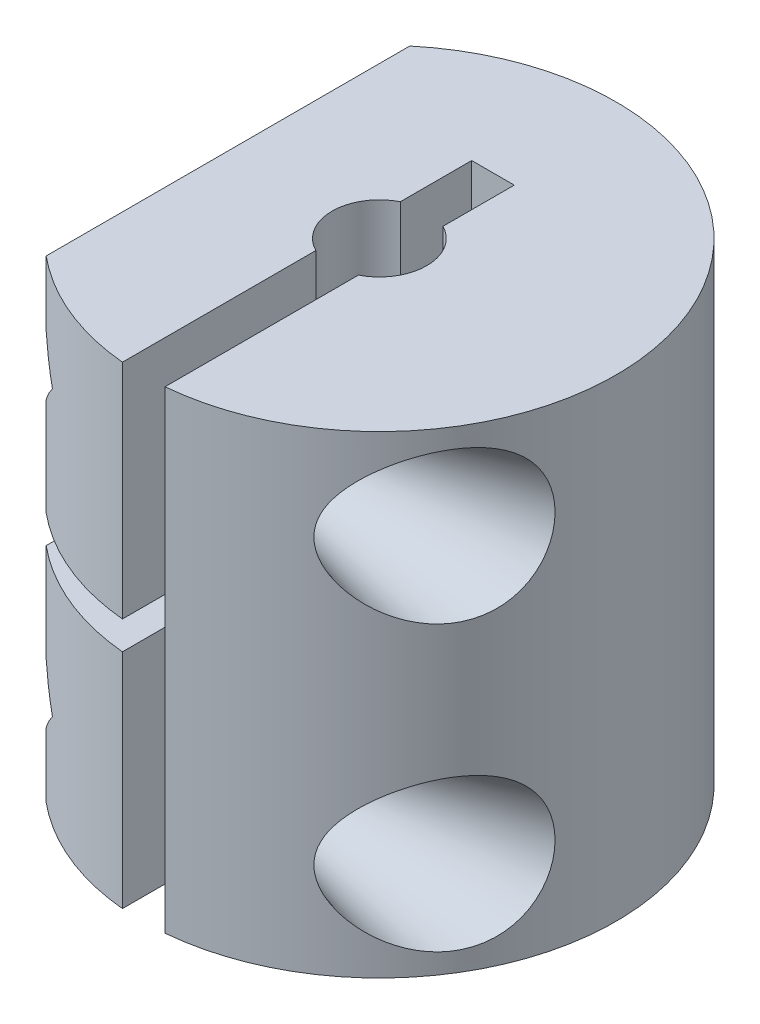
ISO-10303-21;
HEADER;
FILE_DESCRIPTION(('STEP AP214'),'2;1');
FILE_NAME('part.step','',(''),(''),'','','');
FILE_SCHEMA(('AUTOMOTIVE_DESIGN { 1 0 10303 214 1 1 1 1 }'));
ENDSEC;
DATA;
#1=APPLICATION_CONTEXT('core data for automotive mechanical design processes');
#2=APPLICATION_PROTOCOL_DEFINITION('international standard','automotive_design',2000,#1);
#3=PRODUCT_CONTEXT('',#1,'mechanical');
#4=PRODUCT('Part','Part','',(#3));
#5=PRODUCT_RELATED_PRODUCT_CATEGORY('part','',(#4));
#6=PRODUCT_DEFINITION_FORMATION('','',#4);
#7=PRODUCT_DEFINITION_CONTEXT('part definition',#1,'design');
#8=PRODUCT_DEFINITION('design','',#6,#7);
#9=PRODUCT_DEFINITION_SHAPE('','',#8);
#10=(LENGTH_UNIT() NAMED_UNIT(*) SI_UNIT(.MILLI.,.METRE.));
#11=(NAMED_UNIT(*) PLANE_ANGLE_UNIT() SI_UNIT($,.RADIAN.));
#12=(NAMED_UNIT(*) SI_UNIT($,.STERADIAN.) SOLID_ANGLE_UNIT());
#13=UNCERTAINTY_MEASURE_WITH_UNIT(LENGTH_MEASURE(1.E-05),#10,'distance_accuracy_value','');
#14=(GEOMETRIC_REPRESENTATION_CONTEXT(3) GLOBAL_UNCERTAINTY_ASSIGNED_CONTEXT((#13)) GLOBAL_UNIT_ASSIGNED_CONTEXT((#10,
#11,#12)) REPRESENTATION_CONTEXT('',''));
#15=CARTESIAN_POINT('',(0.,0.,0.));
#16=DIRECTION('',(0.,0.,1.));
#17=DIRECTION('',(1.,0.,0.));
#18=AXIS2_PLACEMENT_3D('',#15,#16,#17);
#19=CARTESIAN_POINT('',(-12.5,20.,7.34092172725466));
#20=DIRECTION('',(1.,0.,0.));
#21=DIRECTION('',(0.,0.,-1.));
#22=AXIS2_PLACEMENT_3D('',#19,#20,#21);
#23=CYLINDRICAL_SURFACE('',#22,1.5);
#24=CARTESIAN_POINT('',(-1.125,20.,7.34092172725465));
#25=DIRECTION('',(-1.,0.,0.));
#26=DIRECTION('',(0.,0.,1.));
#27=AXIS2_PLACEMENT_3D('',#24,#25,#26);
#28=CIRCLE('',#27,1.5);
#29=CARTESIAN_POINT('',(-1.125,20.,5.84092172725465));
#30=VERTEX_POINT('',#29);
#31=EDGE_CURVE('E462',#30,#30,#28,.F.);
#32=CARTESIAN_POINT('',(-5.,20.,7.34092172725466));
#33=DIRECTION('',(-1.,0.,0.));
#34=DIRECTION('',(0.,0.,1.));
#35=AXIS2_PLACEMENT_3D('',#32,#33,#34);
#36=CIRCLE('',#35,1.5);
#37=CARTESIAN_POINT('',(-5.,20.,5.84092172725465));
#38=VERTEX_POINT('',#37);
#39=EDGE_CURVE('E392',#38,#38,#36,.T.);
#40=CARTESIAN_POINT('',(-1.125,20.,5.84092172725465));
#41=CARTESIAN_POINT('',(-1.16536458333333,20.,5.84092172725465));
#42=CARTESIAN_POINT('',(-1.20572916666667,20.,5.84092172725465));
#43=CARTESIAN_POINT('',(-1.28645833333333,20.,5.84092172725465));
#44=CARTESIAN_POINT('',(-1.32682291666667,20.,5.84092172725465));
#45=CARTESIAN_POINT('',(-1.40755208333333,20.,5.84092172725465));
#46=CARTESIAN_POINT('',(-1.44791666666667,20.,5.84092172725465));
#47=CARTESIAN_POINT('',(-1.52864583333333,20.,5.84092172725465));
#48=CARTESIAN_POINT('',(-1.56901041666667,20.,5.84092172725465));
#49=CARTESIAN_POINT('',(-1.64973958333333,20.,5.84092172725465));
#50=CARTESIAN_POINT('',(-1.69010416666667,20.,5.84092172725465));
#51=CARTESIAN_POINT('',(-1.77083333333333,20.,5.84092172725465));
#52=CARTESIAN_POINT('',(-1.81119791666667,20.,5.84092172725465));
#53=CARTESIAN_POINT('',(-1.89192708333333,20.,5.84092172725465));
#54=CARTESIAN_POINT('',(-1.93229166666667,20.,5.84092172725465));
#55=CARTESIAN_POINT('',(-2.01302083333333,20.,5.84092172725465));
#56=CARTESIAN_POINT('',(-2.05338541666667,20.,5.84092172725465));
#57=CARTESIAN_POINT('',(-2.13411458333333,20.,5.84092172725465));
#58=CARTESIAN_POINT('',(-2.17447916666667,20.,5.84092172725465));
#59=CARTESIAN_POINT('',(-2.25520833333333,20.,5.84092172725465));
#60=CARTESIAN_POINT('',(-2.29557291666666,20.,5.84092172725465));
#61=CARTESIAN_POINT('',(-2.37630208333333,20.,5.84092172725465));
#62=CARTESIAN_POINT('',(-2.41666666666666,20.,5.84092172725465));
#63=CARTESIAN_POINT('',(-2.49739583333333,20.,5.84092172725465));
#64=CARTESIAN_POINT('',(-2.53776041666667,20.,5.84092172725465));
#65=CARTESIAN_POINT('',(-2.61848958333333,20.,5.84092172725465));
#66=CARTESIAN_POINT('',(-2.65885416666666,20.,5.84092172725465));
#67=CARTESIAN_POINT('',(-2.73958333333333,20.,5.84092172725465));
#68=CARTESIAN_POINT('',(-2.77994791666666,20.,5.84092172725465));
#69=CARTESIAN_POINT('',(-2.86067708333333,20.,5.84092172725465));
#70=CARTESIAN_POINT('',(-2.90104166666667,20.,5.84092172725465));
#71=CARTESIAN_POINT('',(-2.98177083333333,20.,5.84092172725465));
#72=CARTESIAN_POINT('',(-3.02213541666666,20.,5.84092172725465));
#73=CARTESIAN_POINT('',(-3.10286458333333,20.,5.84092172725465));
#74=CARTESIAN_POINT('',(-3.14322916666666,20.,5.84092172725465));
#75=CARTESIAN_POINT('',(-3.22395833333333,20.,5.84092172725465));
#76=CARTESIAN_POINT('',(-3.26432291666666,20.,5.84092172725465));
#77=CARTESIAN_POINT('',(-3.34505208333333,20.,5.84092172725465));
#78=CARTESIAN_POINT('',(-3.38541666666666,20.,5.84092172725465));
#79=CARTESIAN_POINT('',(-3.46614583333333,20.,5.84092172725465));
#80=CARTESIAN_POINT('',(-3.50651041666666,20.,5.84092172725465));
#81=CARTESIAN_POINT('',(-3.58723958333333,20.,5.84092172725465));
#82=CARTESIAN_POINT('',(-3.62760416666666,20.,5.84092172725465));
#83=CARTESIAN_POINT('',(-3.70833333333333,20.,5.84092172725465));
#84=CARTESIAN_POINT('',(-3.74869791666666,20.,5.84092172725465));
#85=CARTESIAN_POINT('',(-3.82942708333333,20.,5.84092172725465));
#86=CARTESIAN_POINT('',(-3.86979166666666,20.,5.84092172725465));
#87=CARTESIAN_POINT('',(-3.95052083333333,20.,5.84092172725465));
#88=CARTESIAN_POINT('',(-3.99088541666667,20.,5.84092172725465));
#89=CARTESIAN_POINT('',(-4.07161458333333,20.,5.84092172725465));
#90=CARTESIAN_POINT('',(-4.11197916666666,20.,5.84092172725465));
#91=CARTESIAN_POINT('',(-4.19270833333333,20.,5.84092172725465));
#92=CARTESIAN_POINT('',(-4.23307291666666,20.,5.84092172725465));
#93=CARTESIAN_POINT('',(-4.31380208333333,20.,5.84092172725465));
#94=CARTESIAN_POINT('',(-4.35416666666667,20.,5.84092172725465));
#95=CARTESIAN_POINT('',(-4.43489583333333,20.,5.84092172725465));
#96=CARTESIAN_POINT('',(-4.47526041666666,20.,5.84092172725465));
#97=CARTESIAN_POINT('',(-4.55598958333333,20.,5.84092172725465));
#98=CARTESIAN_POINT('',(-4.59635416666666,20.,5.84092172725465));
#99=CARTESIAN_POINT('',(-4.67708333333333,20.,5.84092172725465));
#100=CARTESIAN_POINT('',(-4.71744791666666,20.,5.84092172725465));
#101=CARTESIAN_POINT('',(-4.79817708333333,20.,5.84092172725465));
#102=CARTESIAN_POINT('',(-4.83854166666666,20.,5.84092172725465));
#103=CARTESIAN_POINT('',(-4.91927083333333,20.,5.84092172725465));
#104=CARTESIAN_POINT('',(-4.95963541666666,20.,5.84092172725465));
#105=CARTESIAN_POINT('',(-5.,20.,5.84092172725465));
#106=B_SPLINE_CURVE_WITH_KNOTS('',3,(#40,#41,#42,#43,#44,#45,#46,#47,#48,#49,#50,#51,#52,#53,
#54,#55,#56,#57,#58,#59,#60,#61,#62,#63,#64,#65,#66,#67,#68,#69,#70,#71,#72,#73,#74,#75,#76,#77,
#78,#79,#80,#81,#82,#83,#84,#85,#86,#87,#88,#89,#90,#91,#92,#93,#94,#95,#96,#97,#98,#99,#100,
#101,#102,#103,#104,#105),.UNSPECIFIED.,.F.,.F.,(4,2,2,2,2,2,2,2,2,2,2,2,2,2,2,2,2,2,2,2,2,2,2,
2,2,2,2,2,2,2,2,2,4),(0.,0.121093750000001,0.242187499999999,0.36328125,0.484375,
0.605468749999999,0.7265625,0.84765625,0.968749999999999,1.08984375,1.2109375,1.33203125,
1.453125,1.57421875,1.6953125,1.81640625,1.9375,2.05859375,2.1796875,2.30078125,2.421875,
2.54296875,2.6640625,2.78515625,2.90625,3.02734375,3.1484375,3.26953125,3.390625,3.51171875,
3.6328125,3.75390625,3.875),.UNSPECIFIED.);
#107=EDGE_CURVE('BSEAM45',#30,#38,#106,.T.);
#108=ORIENTED_EDGE('',*,*,#31,.T.);
#109=ORIENTED_EDGE('',*,*,#39,.T.);
#110=ORIENTED_EDGE('',*,*,#107,.T.);
#111=ORIENTED_EDGE('',*,*,#107,.F.);
#112=EDGE_LOOP('',(#108,#110,#109,#111));
#113=FACE_BOUND('',#112,.T.);
#114=ADVANCED_FACE('F45',(#113),#23,.F.);
#115=CARTESIAN_POINT('',(0.,25.,0.));
#116=DIRECTION('',(0.,-1.,0.));
#117=DIRECTION('',(0.,0.,-1.));
#118=AXIS2_PLACEMENT_3D('',#115,#116,#117);
#119=CYLINDRICAL_SURFACE('',#118,12.5);
#120=DIRECTION('',(0.,1.,0.));
#121=VECTOR('',#120,1.);
#122=CARTESIAN_POINT('',(-8.,0.,9.60468635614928));
#123=LINE('',#122,#121);
#124=CARTESIAN_POINT('',(-8.,21.5790446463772,9.60468635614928));
#125=VERTEX_POINT('',#124);
#126=CARTESIAN_POINT('',(-8.,25.,9.60468635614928));
#127=VERTEX_POINT('',#126);
#128=EDGE_CURVE('E397',#125,#127,#123,.T.);
#129=ORIENTED_EDGE('',*,*,#128,.F.);
#130=CARTESIAN_POINT('',(0.,38.2148494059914,0.));
#131=DIRECTION('',(0.,0.5,0.866025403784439));
#132=DIRECTION('',(0.,-0.866025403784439,0.5));
#133=AXIS2_PLACEMENT_3D('',#130,#131,#132);
#134=ELLIPSE('',#133,25.,12.5);
#135=CARTESIAN_POINT('',(-6.75695348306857,20.,10.5163482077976));
#136=VERTEX_POINT('',#135);
#137=EDGE_CURVE('E380',#125,#136,#134,.T.);
#138=ORIENTED_EDGE('',*,*,#137,.T.);
#139=CARTESIAN_POINT('',(0.,1.78515059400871,0.));
#140=DIRECTION('',(0.,-0.500000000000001,0.866025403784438));
#141=DIRECTION('',(0.,-0.866025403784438,-0.500000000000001));
#142=AXIS2_PLACEMENT_3D('',#139,#140,#141);
#143=ELLIPSE('',#142,25.,12.5);
#144=CARTESIAN_POINT('',(-8.,18.4209553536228,9.60468635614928));
#145=VERTEX_POINT('',#144);
#146=EDGE_CURVE('E303',#136,#145,#143,.T.);
#147=ORIENTED_EDGE('',*,*,#146,.T.);
#148=CARTESIAN_POINT('',(-8.,13.25,9.60468635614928));
#149=VERTEX_POINT('',#148);
#150=EDGE_CURVE('E411',#149,#145,#123,.T.);
#151=ORIENTED_EDGE('',*,*,#150,.F.);
#152=CARTESIAN_POINT('',(0.,13.25,0.));
#153=DIRECTION('',(0.,-1.,0.));
#154=DIRECTION('',(0.,0.,-1.));
#155=AXIS2_PLACEMENT_3D('',#152,#153,#154);
#156=CIRCLE('',#155,12.5);
#157=CARTESIAN_POINT('',(-1.125,13.25,12.4492720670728));
#158=VERTEX_POINT('',#157);
#159=EDGE_CURVE('E428',#158,#149,#156,.T.);
#160=ORIENTED_EDGE('',*,*,#159,.F.);
#161=DIRECTION('',(0.,-1.,0.));
#162=VECTOR('',#161,1.);
#163=CARTESIAN_POINT('',(-1.125,25.,12.4492720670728));
#164=LINE('',#163,#162);
#165=CARTESIAN_POINT('',(-1.125,25.,12.4492720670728));
#166=VERTEX_POINT('',#165);
#167=EDGE_CURVE('E650',#158,#166,#164,.F.);
#168=ORIENTED_EDGE('',*,*,#167,.T.);
#169=CARTESIAN_POINT('',(0.,25.,0.));
#170=DIRECTION('',(0.,1.,0.));
#171=DIRECTION('',(0.,0.,1.));
#172=AXIS2_PLACEMENT_3D('',#169,#170,#171);
#173=CIRCLE('',#172,12.5);
#174=EDGE_CURVE('E631',#127,#166,#173,.T.);
#175=ORIENTED_EDGE('',*,*,#174,.F.);
#176=EDGE_LOOP('',(#129,#138,#147,#151,#160,#168,#175));
#177=FACE_BOUND('',#176,.T.);
#178=ADVANCED_FACE('F508',(#177),#119,.T.);
#179=CARTESIAN_POINT('',(-8.,6.5790446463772,9.60468635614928));
#180=VERTEX_POINT('',#179);
#181=CARTESIAN_POINT('',(-8.,11.75,9.60468635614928));
#182=VERTEX_POINT('',#181);
#183=EDGE_CURVE('E410',#180,#182,#123,.T.);
#184=ORIENTED_EDGE('',*,*,#183,.F.);
#185=CARTESIAN_POINT('',(0.,23.2148494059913,0.));
#186=DIRECTION('',(0.,0.500000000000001,0.866025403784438));
#187=DIRECTION('',(0.,-0.866025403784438,0.500000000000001));
#188=AXIS2_PLACEMENT_3D('',#185,#186,#187);
#189=ELLIPSE('',#188,25.,12.5);
#190=CARTESIAN_POINT('',(-6.75695348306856,5.,10.5163482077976));
#191=VERTEX_POINT('',#190);
#192=EDGE_CURVE('E388',#180,#191,#189,.T.);
#193=ORIENTED_EDGE('',*,*,#192,.T.);
#194=CARTESIAN_POINT('',(0.,-13.2148494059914,0.));
#195=DIRECTION('',(0.,-0.5,0.866025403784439));
#196=DIRECTION('',(0.,-0.866025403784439,-0.5));
#197=AXIS2_PLACEMENT_3D('',#194,#195,#196);
#198=ELLIPSE('',#197,25.,12.5);
#199=CARTESIAN_POINT('',(-8.,3.42095535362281,9.60468635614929));
#200=VERTEX_POINT('',#199);
#201=EDGE_CURVE('E384',#191,#200,#198,.T.);
#202=ORIENTED_EDGE('',*,*,#201,.T.);
#203=CARTESIAN_POINT('',(-8.,0.,9.60468635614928));
#204=VERTEX_POINT('',#203);
#205=EDGE_CURVE('E406',#204,#200,#123,.T.);
#206=ORIENTED_EDGE('',*,*,#205,.F.);
#207=CARTESIAN_POINT('',(0.,0.,0.));
#208=DIRECTION('',(0.,1.,0.));
#209=DIRECTION('',(0.,0.,1.));
#210=AXIS2_PLACEMENT_3D('',#207,#208,#209);
#211=CIRCLE('',#210,12.5);
#212=CARTESIAN_POINT('',(-1.125,0.,12.4492720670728));
#213=VERTEX_POINT('',#212);
#214=EDGE_CURVE('E632',#204,#213,#211,.T.);
#215=ORIENTED_EDGE('',*,*,#214,.T.);
#216=CARTESIAN_POINT('',(-1.12500000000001,11.75,12.4492720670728));
#217=VERTEX_POINT('',#216);
#218=EDGE_CURVE('E646',#213,#217,#164,.F.);
#219=ORIENTED_EDGE('',*,*,#218,.T.);
#220=CARTESIAN_POINT('',(0.,11.75,0.));
#221=DIRECTION('',(0.,1.,0.));
#222=DIRECTION('',(0.,0.,1.));
#223=AXIS2_PLACEMENT_3D('',#220,#221,#222);
#224=CIRCLE('',#223,12.5);
#225=EDGE_CURVE('E437',#182,#217,#224,.T.);
#226=ORIENTED_EDGE('',*,*,#225,.F.);
#227=EDGE_LOOP('',(#184,#193,#202,#206,#215,#219,#226));
#228=FACE_BOUND('',#227,.T.);
#229=ADVANCED_FACE('F514',(#228),#119,.T.);
#230=CARTESIAN_POINT('',(7.20946151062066,18.7513909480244,10.2114481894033));
#231=CARTESIAN_POINT('',(7.15183445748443,18.883660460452,10.252134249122));
#232=CARTESIAN_POINT('',(7.1012009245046,19.0209637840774,10.2871499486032));
#233=CARTESIAN_POINT('',(7.03918634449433,19.2329186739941,10.3295926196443));
#234=CARTESIAN_POINT('',(7.02083316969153,19.304598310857,10.3420628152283));
#235=CARTESIAN_POINT('',(6.9892792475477,19.4495953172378,10.3634135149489));
#236=CARTESIAN_POINT('',(6.9760758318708,19.5229118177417,10.3722958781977));
#237=CARTESIAN_POINT('',(6.95516111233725,19.6712841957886,10.3863321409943));
#238=CARTESIAN_POINT('',(6.94749448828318,19.7463492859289,10.3914557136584));
#239=CARTESIAN_POINT('',(6.93809819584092,19.8970199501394,10.3977317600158));
#240=CARTESIAN_POINT('',(6.93636855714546,19.9726255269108,10.3988842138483));
#241=CARTESIAN_POINT('',(6.93891401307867,20.1236783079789,10.3971859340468));
#242=CARTESIAN_POINT('',(6.94318796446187,20.1991255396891,10.3943359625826));
#243=CARTESIAN_POINT('',(6.95757036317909,20.3491864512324,10.3847140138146));
#244=CARTESIAN_POINT('',(6.96767867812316,20.4238001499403,10.3779421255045));
#245=CARTESIAN_POINT('',(7.00358510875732,20.6301038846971,10.3537716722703));
#246=CARTESIAN_POINT('',(7.03546947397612,20.7602977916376,10.3322043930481));
#247=CARTESIAN_POINT('',(7.11391743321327,21.0137077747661,10.2783475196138));
#248=CARTESIAN_POINT('',(7.16049037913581,21.1369193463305,10.2460510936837));
#249=CARTESIAN_POINT('',(7.29732460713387,21.4490633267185,10.1493660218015));
#250=CARTESIAN_POINT('',(7.39681530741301,21.6316622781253,10.0774693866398));
#251=CARTESIAN_POINT('',(7.55982193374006,21.8895842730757,9.95508960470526));
#252=CARTESIAN_POINT('',(7.61657863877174,21.9730447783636,9.91177364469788));
#253=CARTESIAN_POINT('',(7.73371577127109,22.1348181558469,9.82064793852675));
#254=CARTESIAN_POINT('',(7.79409523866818,22.2131323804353,9.77283938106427));
#255=CARTESIAN_POINT('',(7.94589049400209,22.3994760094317,9.65019244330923));
#256=CARTESIAN_POINT('',(8.03885796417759,22.5046917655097,9.5730012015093));
#257=CARTESIAN_POINT('',(8.22860368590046,22.7048820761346,9.41040448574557));
#258=CARTESIAN_POINT('',(8.32538357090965,22.7998521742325,9.32499546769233));
#259=CARTESIAN_POINT('',(8.5212339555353,22.9797252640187,9.14637367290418));
#260=CARTESIAN_POINT('',(8.62030595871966,23.0646214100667,9.05315566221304));
#261=CARTESIAN_POINT('',(8.81940186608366,23.224173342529,8.85931460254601));
#262=CARTESIAN_POINT('',(8.91942562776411,23.2988306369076,8.75869264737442));
#263=CARTESIAN_POINT('',(9.12128107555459,23.4389262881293,8.54832642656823));
#264=CARTESIAN_POINT('',(9.22311080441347,23.5041613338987,8.43844463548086));
#265=CARTESIAN_POINT('',(9.42564938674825,23.6231074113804,8.21159270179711));
#266=CARTESIAN_POINT('',(9.52635811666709,23.6768171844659,8.09462178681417));
#267=CARTESIAN_POINT('',(9.72550931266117,23.7718307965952,7.85422144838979));
#268=CARTESIAN_POINT('',(9.82395505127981,23.8131537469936,7.73080232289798));
#269=CARTESIAN_POINT('',(10.017756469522,23.882513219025,7.47796106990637));
#270=CARTESIAN_POINT('',(10.1131130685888,23.9105537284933,7.34854075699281));
#271=CARTESIAN_POINT('',(10.2785247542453,23.9474973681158,7.1146003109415));
#272=CARTESIAN_POINT('',(10.3494009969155,23.9593028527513,7.01111301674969));
#273=CARTESIAN_POINT('',(10.488274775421,23.9737828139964,6.80160823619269));
#274=CARTESIAN_POINT('',(10.5562729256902,23.9764592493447,6.69559129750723));
#275=CARTESIAN_POINT('',(10.6889481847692,23.9721504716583,6.48168383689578));
#276=CARTESIAN_POINT('',(10.753625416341,23.9651656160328,6.37379338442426));
#277=CARTESIAN_POINT('',(10.8791977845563,23.9410527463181,6.1570070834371));
#278=CARTESIAN_POINT('',(10.9400948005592,23.9239298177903,6.04811176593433));
#279=CARTESIAN_POINT('',(11.0581961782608,23.8789744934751,5.82939617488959));
#280=CARTESIAN_POINT('',(11.1153685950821,23.8510608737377,5.71957521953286));
#281=CARTESIAN_POINT('',(11.2251310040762,23.7842817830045,5.50103428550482));
#282=CARTESIAN_POINT('',(11.2777231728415,23.7454215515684,5.39231380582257));
#283=CARTESIAN_POINT('',(11.3780815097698,23.6566704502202,5.17719489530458));
#284=CARTESIAN_POINT('',(11.4258487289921,23.6067819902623,5.07079596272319));
#285=CARTESIAN_POINT('',(11.516408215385,23.4961010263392,4.86161795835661));
#286=CARTESIAN_POINT('',(11.5592011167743,23.4353099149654,4.75883842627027));
#287=CARTESIAN_POINT('',(11.6349393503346,23.3111142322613,4.57025657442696));
#288=CARTESIAN_POINT('',(11.6684502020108,23.248897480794,4.48389648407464));
#289=CARTESIAN_POINT('',(11.7316523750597,23.1166542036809,4.31583074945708));
#290=CARTESIAN_POINT('',(11.761342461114,23.0466251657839,4.2341266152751));
#291=CARTESIAN_POINT('',(11.8169837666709,22.8993113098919,4.07626039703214));
#292=CARTESIAN_POINT('',(11.8429370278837,22.8220304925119,4.0000952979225));
#293=CARTESIAN_POINT('',(11.8912968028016,22.660740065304,3.85395744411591));
#294=CARTESIAN_POINT('',(11.9137019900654,22.5767279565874,3.78398700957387));
#295=CARTESIAN_POINT('',(11.9542626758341,22.4064051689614,3.65377282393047));
#296=CARTESIAN_POINT('',(11.9725595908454,22.3203491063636,3.59324002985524));
#297=CARTESIAN_POINT('',(12.0062761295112,22.143320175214,3.4789192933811));
#298=CARTESIAN_POINT('',(12.0216947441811,22.0523455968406,3.42513371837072));
#299=CARTESIAN_POINT('',(12.0639181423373,21.7730652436,3.27457012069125));
#300=CARTESIAN_POINT('',(12.0867274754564,21.5782419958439,3.18846240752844));
#301=CARTESIAN_POINT('',(12.1236016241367,21.1713303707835,3.04531423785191));
#302=CARTESIAN_POINT('',(12.1374031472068,20.9589109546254,2.98915707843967));
#303=CARTESIAN_POINT('',(12.1563919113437,20.5274666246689,2.91097187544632));
#304=CARTESIAN_POINT('',(12.161577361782,20.308440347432,2.88895092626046));
#305=CARTESIAN_POINT('',(12.1638351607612,19.8623964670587,2.87943767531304));
#306=CARTESIAN_POINT('',(12.1606360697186,19.6353521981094,2.8931005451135));
#307=CARTESIAN_POINT('',(12.1452327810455,19.186772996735,2.95709085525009));
#308=CARTESIAN_POINT('',(12.133027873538,18.9652385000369,3.00742118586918));
#309=CARTESIAN_POINT('',(12.0984389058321,18.5333600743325,3.14367770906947));
#310=CARTESIAN_POINT('',(12.0760203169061,18.323056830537,3.22972455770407));
#311=CARTESIAN_POINT('',(12.0192698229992,17.9209995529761,3.43488294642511));
#312=CARTESIAN_POINT('',(11.9849407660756,17.7292410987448,3.55398658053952));
#313=CARTESIAN_POINT('',(11.9036567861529,17.3758162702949,3.81723642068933));
#314=CARTESIAN_POINT('',(11.8571065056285,17.213426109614,3.960535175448));
#315=CARTESIAN_POINT('',(11.7494849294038,16.9169728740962,4.26921821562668));
#316=CARTESIAN_POINT('',(11.6884182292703,16.7829008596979,4.43459550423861));
#317=CARTESIAN_POINT('',(11.5532478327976,16.5503942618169,4.77545318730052));
#318=CARTESIAN_POINT('',(11.4796219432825,16.4509596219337,4.95044326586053));
#319=CARTESIAN_POINT('',(11.3183928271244,16.2834378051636,5.30872446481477));
#320=CARTESIAN_POINT('',(11.2307888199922,16.2153523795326,5.49201604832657));
#321=CARTESIAN_POINT('',(11.0404659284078,16.1089613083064,5.86541489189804));
#322=CARTESIAN_POINT('',(10.9374260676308,16.0714360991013,6.05557844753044));
#323=CARTESIAN_POINT('',(10.7198811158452,16.0271848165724,6.43285802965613));
#324=CARTESIAN_POINT('',(10.6053704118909,16.0204738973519,6.61997251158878));
#325=CARTESIAN_POINT('',(10.3533751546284,16.0360613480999,7.00836627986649));
#326=CARTESIAN_POINT('',(10.2147665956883,16.061815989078,7.20877001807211));
#327=CARTESIAN_POINT('',(9.9295634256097,16.1443953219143,7.59683594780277));
#328=CARTESIAN_POINT('',(9.78296822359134,16.2012223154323,7.78449719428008));
#329=CARTESIAN_POINT('',(9.45770346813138,16.3554120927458,8.17790601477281));
#330=CARTESIAN_POINT('',(9.27805838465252,16.4582758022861,8.38071463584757));
#331=CARTESIAN_POINT('',(9.00755587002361,16.6386058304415,8.66783917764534));
#332=CARTESIAN_POINT('',(8.91703184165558,16.7032120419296,8.76086993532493));
#333=CARTESIAN_POINT('',(8.73646013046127,16.8408649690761,8.94094413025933));
#334=CARTESIAN_POINT('',(8.64641232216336,16.913909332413,9.02798922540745));
#335=CARTESIAN_POINT('',(8.45316399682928,17.0808076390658,9.20946904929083));
#336=CARTESIAN_POINT('',(8.35019525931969,17.1761158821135,9.30281739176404));
#337=CARTESIAN_POINT('',(8.14762890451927,17.3780663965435,9.48073386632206));
#338=CARTESIAN_POINT('',(8.0480333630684,17.4847154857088,9.56529665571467));
#339=CARTESIAN_POINT('',(7.85499702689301,17.708976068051,9.72443182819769));
#340=CARTESIAN_POINT('',(7.76152359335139,17.826519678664,9.79905983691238));
#341=CARTESIAN_POINT('',(7.58307046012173,18.0734981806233,9.93779486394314));
#342=CARTESIAN_POINT('',(7.49807721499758,18.2029134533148,10.0019187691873));
#343=CARTESIAN_POINT('',(7.38102693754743,18.4043536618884,10.0882467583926));
#344=CARTESIAN_POINT('',(7.34421991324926,18.4716766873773,10.1150533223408));
#345=CARTESIAN_POINT('',(7.27407331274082,18.6093005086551,10.165614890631));
#346=CARTESIAN_POINT('',(7.2407374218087,18.6796043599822,10.1893666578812));
#347=CARTESIAN_POINT('',(7.20946151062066,18.7513909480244,10.2114481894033));
#348=B_SPLINE_CURVE_WITH_KNOTS('',3,(#230,#231,#232,#233,#234,#235,#236,#237,#238,#239,#240,
#241,#242,#243,#244,#245,#246,#247,#248,#249,#250,#251,#252,#253,#254,#255,#256,#257,#258,#259,
#260,#261,#262,#263,#264,#265,#266,#267,#268,#269,#270,#271,#272,#273,#274,#275,#276,#277,#278,
#279,#280,#281,#282,#283,#284,#285,#286,#287,#288,#289,#290,#291,#292,#293,#294,#295,#296,#297,
#298,#299,#300,#301,#302,#303,#304,#305,#306,#307,#308,#309,#310,#311,#312,#313,#314,#315,#316,
#317,#318,#319,#320,#321,#322,#323,#324,#325,#326,#327,#328,#329,#330,#331,#332,#333,#334,#335,
#336,#337,#338,#339,#340,#341,#342,#343,#344,#345,#346,#347),.UNSPECIFIED.,.T.,.F.,(4,2,2,2,2,2,
2,2,2,2,2,2,2,2,2,2,2,2,2,2,2,2,2,2,2,2,2,2,2,2,2,2,2,2,2,2,2,2,2,2,2,2,2,2,2,2,2,2,2,2,2,2,2,2,
2,2,2,2,4),(0.,0.449424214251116,0.674305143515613,0.899069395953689,1.12562773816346,
1.35218721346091,1.57870355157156,1.8052147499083,2.21074435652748,2.61653267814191,
3.27258858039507,3.60192275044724,3.93117002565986,4.41117882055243,4.89139556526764,
5.37193678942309,5.85240716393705,6.34205426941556,6.83175482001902,7.32069588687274,
7.80949006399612,8.18709334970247,8.56461561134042,8.94212390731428,9.31944299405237,
9.69965935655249,10.079694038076,10.4596457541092,10.8395489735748,11.1738900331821,
11.5083389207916,11.8426043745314,12.1769944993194,12.4969904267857,12.8170983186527,
13.4567043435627,14.1142552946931,14.7719428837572,15.4511832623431,16.1304771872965,
16.8120847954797,17.4935295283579,18.1547644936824,18.8157904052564,19.455738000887,
20.095721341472,20.7515767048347,21.4077545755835,22.1400682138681,22.8724361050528,
23.7383072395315,24.1730038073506,24.6075794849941,25.1125375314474,25.6178008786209,
26.1201041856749,26.6215918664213,26.8652516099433,27.1091674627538),.UNSPECIFIED.);
#349=CARTESIAN_POINT('',(7.20946151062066,18.7513909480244,10.2114481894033));
#350=VERTEX_POINT('',#349);
#351=EDGE_CURVE('E461',#350,#350,#348,.T.);
#352=ORIENTED_EDGE('',*,*,#351,.T.);
#353=EDGE_LOOP('',(#352));
#354=FACE_BOUND('',#353,.T.);
#355=CARTESIAN_POINT('',(7.11839854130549,3.98158467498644,10.2751351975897));
#356=CARTESIAN_POINT('',(7.07190234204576,4.11243022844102,10.3073487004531));
#357=CARTESIAN_POINT('',(7.03288333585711,4.24750033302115,10.3339175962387));
#358=CARTESIAN_POINT('',(6.98843216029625,4.45443265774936,10.3639821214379));
#359=CARTESIAN_POINT('',(6.97596024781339,4.52414554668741,10.3723728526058));
#360=CARTESIAN_POINT('',(6.95604701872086,4.6646003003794,10.3857381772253));
#361=CARTESIAN_POINT('',(6.94860351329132,4.73534170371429,10.3907142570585));
#362=CARTESIAN_POINT('',(6.93896346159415,4.87766252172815,10.3971544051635));
#363=CARTESIAN_POINT('',(6.93679079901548,4.94924427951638,10.3986024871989));
#364=CARTESIAN_POINT('',(6.93783206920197,5.09235078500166,10.3979078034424));
#365=CARTESIAN_POINT('',(6.94104595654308,5.16387553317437,10.3957650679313));
#366=CARTESIAN_POINT('',(6.95275559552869,5.30630898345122,10.3879371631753));
#367=CARTESIAN_POINT('',(6.9612525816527,5.37721753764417,10.3822511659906));
#368=CARTESIAN_POINT('',(6.98326368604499,5.51791457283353,10.3674588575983));
#369=CARTESIAN_POINT('',(6.99678027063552,5.58770248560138,10.3583508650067));
#370=CARTESIAN_POINT('',(7.03125571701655,5.73796097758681,10.3349866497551));
#371=CARTESIAN_POINT('',(7.05310964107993,5.81812942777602,10.3201036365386));
#372=CARTESIAN_POINT('',(7.10248729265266,5.9758166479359,10.2861836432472));
#373=CARTESIAN_POINT('',(7.13001486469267,6.05333357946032,10.2671438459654));
#374=CARTESIAN_POINT('',(7.21998562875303,6.28159974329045,10.2042701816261));
#375=CARTESIAN_POINT('',(7.28978509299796,6.42793536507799,10.1547030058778));
#376=CARTESIAN_POINT('',(7.42334421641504,6.67174747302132,10.0572835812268));
#377=CARTESIAN_POINT('',(7.48405984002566,6.77212771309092,10.012253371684));
#378=CARTESIAN_POINT('',(7.61125163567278,6.96606937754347,9.91590689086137));
#379=CARTESIAN_POINT('',(7.67773055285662,7.05962751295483,9.8645876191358));
#380=CARTESIAN_POINT('',(7.81504350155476,7.24020867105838,9.75616547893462));
#381=CARTESIAN_POINT('',(7.88588477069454,7.32722027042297,9.69905289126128));
#382=CARTESIAN_POINT('',(8.03065769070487,7.49475418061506,9.57952786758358));
#383=CARTESIAN_POINT('',(8.10458921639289,7.57527675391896,9.51711564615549));
#384=CARTESIAN_POINT('',(8.27985154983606,7.75601456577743,9.36544784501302));
#385=CARTESIAN_POINT('',(8.38203959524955,7.85375223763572,9.27422057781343));
#386=CARTESIAN_POINT('',(8.58856832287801,8.03808625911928,9.08329741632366));
#387=CARTESIAN_POINT('',(8.69290964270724,8.12467925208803,8.98359898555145));
#388=CARTESIAN_POINT('',(8.90239773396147,8.28658252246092,8.77605073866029));
#389=CARTESIAN_POINT('',(9.00754493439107,8.36188627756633,8.66819626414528));
#390=CARTESIAN_POINT('',(9.21737123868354,8.50069294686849,8.44473541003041));
#391=CARTESIAN_POINT('',(9.32205039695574,8.56419726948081,8.32912995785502));
#392=CARTESIAN_POINT('',(9.5301937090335,8.678890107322,8.09015420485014));
#393=CARTESIAN_POINT('',(9.63365281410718,8.73003796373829,7.9667599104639));
#394=CARTESIAN_POINT('',(9.83794919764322,8.81879467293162,7.71305880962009));
#395=CARTESIAN_POINT('',(9.93878614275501,8.85640181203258,7.58275113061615));
#396=CARTESIAN_POINT('',(10.1365237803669,8.91684127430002,7.31630694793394));
#397=CARTESIAN_POINT('',(10.2334327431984,8.93970633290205,7.18018407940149));
#398=CARTESIAN_POINT('',(10.4224362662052,8.9695044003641,6.90296455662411));
#399=CARTESIAN_POINT('',(10.5145331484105,8.97644516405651,6.7618703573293));
#400=CARTESIAN_POINT('',(10.6659039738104,8.97363115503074,6.51938116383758));
#401=CARTESIAN_POINT('',(10.7266917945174,8.96828488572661,6.41886346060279));
#402=CARTESIAN_POINT('',(10.8450497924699,8.94881558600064,6.21679896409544));
#403=CARTESIAN_POINT('',(10.9026207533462,8.93469470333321,6.11525242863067));
#404=CARTESIAN_POINT('',(11.0142114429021,8.89733980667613,5.91190294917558));
#405=CARTESIAN_POINT('',(11.0682318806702,8.87410761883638,5.81010006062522));
#406=CARTESIAN_POINT('',(11.1724214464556,8.81829798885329,5.60713864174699));
#407=CARTESIAN_POINT('',(11.2225923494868,8.7857248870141,5.50597983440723));
#408=CARTESIAN_POINT('',(11.3191384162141,8.71090697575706,5.30468038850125));
#409=CARTESIAN_POINT('',(11.3654914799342,8.66861058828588,5.20454826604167));
#410=CARTESIAN_POINT('',(11.4539134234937,8.57449767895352,5.00695308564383));
#411=CARTESIAN_POINT('',(11.4959840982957,8.5226851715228,4.90948892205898));
#412=CARTESIAN_POINT('',(11.5757889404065,8.4097223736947,4.71824647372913));
#413=CARTESIAN_POINT('',(11.6135226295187,8.34857105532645,4.6244685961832));
#414=CARTESIAN_POINT('',(11.6846569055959,8.21730413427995,4.44166786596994));
#415=CARTESIAN_POINT('',(11.7180577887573,8.14718914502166,4.3526446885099));
#416=CARTESIAN_POINT('',(11.7780106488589,8.00472946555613,4.18754416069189));
#417=CARTESIAN_POINT('',(11.8049015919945,7.9330593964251,4.11100646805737));
#418=CARTESIAN_POINT('',(11.8552636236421,7.78310468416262,3.96343357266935));
#419=CARTESIAN_POINT('',(11.8787335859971,7.70481787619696,3.89240018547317));
#420=CARTESIAN_POINT('',(11.9224015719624,7.5422522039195,3.75651903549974));
#421=CARTESIAN_POINT('',(11.9426010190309,7.45797596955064,3.69166858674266));
#422=CARTESIAN_POINT('',(11.9799371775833,7.28402854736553,3.56864588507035));
#423=CARTESIAN_POINT('',(11.9970727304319,7.19435533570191,3.51047616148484));
#424=CARTESIAN_POINT('',(12.0439469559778,6.91961973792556,3.347552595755));
#425=CARTESIAN_POINT('',(12.0695071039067,6.72747647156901,3.25324585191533));
#426=CARTESIAN_POINT('',(12.1109070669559,6.33003423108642,3.09557849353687));
#427=CARTESIAN_POINT('',(12.1267453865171,6.12473323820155,3.03222264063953));
#428=CARTESIAN_POINT('',(12.1503522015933,5.69877698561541,2.93623929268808));
#429=CARTESIAN_POINT('',(12.1578092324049,5.47783501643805,2.90480175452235));
#430=CARTESIAN_POINT('',(12.1642939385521,5.03362907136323,2.87752453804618));
#431=CARTESIAN_POINT('',(12.1633200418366,4.81036467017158,2.88169149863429));
#432=CARTESIAN_POINT('',(12.1527231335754,4.36218293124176,2.92606581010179));
#433=CARTESIAN_POINT('',(12.1428923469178,4.13735532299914,2.96713888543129));
#434=CARTESIAN_POINT('',(12.1133594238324,3.6980905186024,3.08548451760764));
#435=CARTESIAN_POINT('',(12.0936575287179,3.4836530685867,3.1627561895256));
#436=CARTESIAN_POINT('',(12.0430259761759,3.07376280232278,3.35034685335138));
#437=CARTESIAN_POINT('',(12.0122102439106,2.87814199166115,3.4603286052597));
#438=CARTESIAN_POINT('',(11.9374403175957,2.50975270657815,3.710043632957));
#439=CARTESIAN_POINT('',(11.8934905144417,2.33697662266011,3.8497669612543));
#440=CARTESIAN_POINT('',(11.7926051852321,2.02557506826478,4.14828965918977));
#441=CARTESIAN_POINT('',(11.7361983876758,1.88593835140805,4.30621347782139));
#442=CARTESIAN_POINT('',(11.6086862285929,1.63686670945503,4.63897306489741));
#443=CARTESIAN_POINT('',(11.5375838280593,1.52742571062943,4.8138054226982));
#444=CARTESIAN_POINT('',(11.3821263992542,1.34248125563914,5.17052711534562));
#445=CARTESIAN_POINT('',(11.2980295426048,1.26640886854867,5.3522356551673));
#446=CARTESIAN_POINT('',(11.1166793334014,1.14552892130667,5.71938690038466));
#447=CARTESIAN_POINT('',(11.0194229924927,1.10072847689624,5.90483044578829));
#448=CARTESIAN_POINT('',(10.8075224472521,1.03931982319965,6.28469781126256));
#449=CARTESIAN_POINT('',(10.6921995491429,1.02448318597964,6.47902398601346));
#450=CARTESIAN_POINT('',(10.4512169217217,1.02548507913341,6.86098875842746));
#451=CARTESIAN_POINT('',(10.3255529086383,1.04133638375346,7.04862453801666));
#452=CARTESIAN_POINT('',(10.0475176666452,1.10491641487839,7.44064963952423));
#453=CARTESIAN_POINT('',(9.89393170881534,1.15697725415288,7.64346307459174));
#454=CARTESIAN_POINT('',(9.58039894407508,1.29300537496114,8.03296654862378));
#455=CARTESIAN_POINT('',(9.42044689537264,1.37699945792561,8.21964288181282));
#456=CARTESIAN_POINT('',(9.16351956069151,1.53377927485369,8.50296157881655));
#457=CARTESIAN_POINT('',(9.0672410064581,1.59735613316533,8.60547917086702));
#458=CARTESIAN_POINT('',(8.8747059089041,1.7342525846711,8.80390165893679));
#459=CARTESIAN_POINT('',(8.77844937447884,1.80757422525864,8.89980515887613));
#460=CARTESIAN_POINT('',(8.58689109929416,1.96374354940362,9.08477018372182));
#461=CARTESIAN_POINT('',(8.49159024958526,2.04659936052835,9.17382576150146));
#462=CARTESIAN_POINT('',(8.30319401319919,2.22171436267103,9.34468448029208));
#463=CARTESIAN_POINT('',(8.21009799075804,2.31397080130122,9.42648973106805));
#464=CARTESIAN_POINT('',(8.0491399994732,2.48507766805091,9.56398129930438));
#465=CARTESIAN_POINT('',(7.9805222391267,2.5619304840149,9.62126585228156));
#466=CARTESIAN_POINT('',(7.84622343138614,2.72133001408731,9.73110148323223));
#467=CARTESIAN_POINT('',(7.78054268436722,2.80387730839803,9.78365207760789));
#468=CARTESIAN_POINT('',(7.58973108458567,3.05981986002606,9.93336874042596));
#469=CARTESIAN_POINT('',(7.47017715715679,3.24218949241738,10.023149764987));
#470=CARTESIAN_POINT('',(7.3169697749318,3.52269963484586,10.1348618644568));
#471=CARTESIAN_POINT('',(7.27256832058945,3.61115797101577,10.1667260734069));
#472=CARTESIAN_POINT('',(7.19024651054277,3.79285326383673,10.2251102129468));
#473=CARTESIAN_POINT('',(7.15233133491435,3.88609396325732,10.2516258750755));
#474=CARTESIAN_POINT('',(7.11839854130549,3.98158467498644,10.2751351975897));
#475=B_SPLINE_CURVE_WITH_KNOTS('',3,(#355,#356,#357,#358,#359,#360,#361,#362,#363,#364,#365,
#366,#367,#368,#369,#370,#371,#372,#373,#374,#375,#376,#377,#378,#379,#380,#381,#382,#383,#384,
#385,#386,#387,#388,#389,#390,#391,#392,#393,#394,#395,#396,#397,#398,#399,#400,#401,#402,#403,
#404,#405,#406,#407,#408,#409,#410,#411,#412,#413,#414,#415,#416,#417,#418,#419,#420,#421,#422,
#423,#424,#425,#426,#427,#428,#429,#430,#431,#432,#433,#434,#435,#436,#437,#438,#439,#440,#441,
#442,#443,#444,#445,#446,#447,#448,#449,#450,#451,#452,#453,#454,#455,#456,#457,#458,#459,#460,
#461,#462,#463,#464,#465,#466,#467,#468,#469,#470,#471,#472,#473,#474),.UNSPECIFIED.,.T.,.F.,(4,
2,2,2,2,2,2,2,2,2,2,2,2,2,2,2,2,2,2,2,2,2,2,2,2,2,2,2,2,2,2,2,2,2,2,2,2,2,2,2,2,2,2,2,2,2,2,2,2,
2,2,2,2,2,2,2,2,2,2,4),(0.,0.427279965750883,0.641004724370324,0.854636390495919,
1.06923428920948,1.2838303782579,1.49847662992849,1.71322848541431,1.96609188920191,
2.21912720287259,2.7255962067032,3.10213920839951,3.47886255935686,3.85622871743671,
4.23357960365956,4.73776012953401,5.24209215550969,5.74671444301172,6.25127645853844,
6.75747678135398,7.26374114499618,7.7688774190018,8.27376764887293,8.62620215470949,
8.978550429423,9.33082812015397,9.68294238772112,10.0369694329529,10.3908474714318,
10.7447644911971,11.0986573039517,11.42301068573,11.747470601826,12.0717889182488,
12.3962296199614,13.0397415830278,13.6833525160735,14.3501631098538,15.017098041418,
15.7000981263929,16.3830815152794,17.0592540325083,17.7352007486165,18.3866342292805,
19.0379365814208,19.6776562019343,20.3175213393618,20.9942247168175,21.6712098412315,
22.4474298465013,23.2243027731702,23.6869371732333,24.1496689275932,24.6127981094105,
25.0757920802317,25.4291651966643,25.7825743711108,26.4861528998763,26.7977329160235,
27.1095606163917),.UNSPECIFIED.);
#476=CARTESIAN_POINT('',(7.11839854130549,3.98158467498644,10.2751351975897));
#477=VERTEX_POINT('',#476);
#478=EDGE_CURVE('E453',#477,#477,#475,.T.);
#479=ORIENTED_EDGE('',*,*,#478,.T.);
#480=EDGE_LOOP('',(#479));
#481=FACE_BOUND('',#480,.T.);
#482=CARTESIAN_POINT('',(1.125,0.,12.4492720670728));
#483=VERTEX_POINT('',#482);
#484=CARTESIAN_POINT('',(-8.,0.,-9.60468635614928));
#485=VERTEX_POINT('',#484);
#486=EDGE_CURVE('E627',#483,#485,#211,.T.);
#487=ORIENTED_EDGE('',*,*,#486,.T.);
#488=DIRECTION('',(0.,1.,0.));
#489=VECTOR('',#488,1.);
#490=CARTESIAN_POINT('',(-8.,0.,-9.60468635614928));
#491=LINE('',#490,#489);
#492=CARTESIAN_POINT('',(-8.,25.,-9.60468635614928));
#493=VERTEX_POINT('',#492);
#494=EDGE_CURVE('E401',#485,#493,#491,.T.);
#495=ORIENTED_EDGE('',*,*,#494,.T.);
#496=CARTESIAN_POINT('',(1.125,25.,12.4492720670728));
#497=VERTEX_POINT('',#496);
#498=EDGE_CURVE('E626',#497,#493,#173,.T.);
#499=ORIENTED_EDGE('',*,*,#498,.F.);
#500=DIRECTION('',(0.,-1.,0.));
#501=VECTOR('',#500,1.);
#502=CARTESIAN_POINT('',(1.125,25.,12.4492720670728));
#503=LINE('',#502,#501);
#504=EDGE_CURVE('E651',#497,#483,#503,.T.);
#505=ORIENTED_EDGE('',*,*,#504,.T.);
#506=EDGE_LOOP('',(#487,#495,#499,#505));
#507=FACE_BOUND('',#506,.T.);
#508=ADVANCED_FACE('F47',(#354,#481,#507),#119,.T.);
#509=CARTESIAN_POINT('',(0.,0.,0.));
#510=DIRECTION('',(0.,1.,0.));
#511=DIRECTION('',(0.,0.,1.));
#512=AXIS2_PLACEMENT_3D('',#509,#510,#511);
#513=CYLINDRICAL_SURFACE('',#512,2.5);
#514=CARTESIAN_POINT('',(0.,11.75,0.));
#515=DIRECTION('',(0.,1.,0.));
#516=DIRECTION('',(0.,0.,1.));
#517=AXIS2_PLACEMENT_3D('',#514,#515,#516);
#518=CIRCLE('',#517,2.5);
#519=CARTESIAN_POINT('',(-1.125,11.75,2.23257138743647));
#520=VERTEX_POINT('',#519);
#521=CARTESIAN_POINT('',(-1.125,11.75,-2.23257138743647));
#522=VERTEX_POINT('',#521);
#523=EDGE_CURVE('E432',#520,#522,#518,.F.);
#524=ORIENTED_EDGE('',*,*,#523,.F.);
#525=DIRECTION('',(0.,1.,0.));
#526=VECTOR('',#525,1.);
#527=CARTESIAN_POINT('',(-1.125,0.,2.23257138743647));
#528=LINE('',#527,#526);
#529=CARTESIAN_POINT('',(-1.125,0.,2.23257138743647));
#530=VERTEX_POINT('',#529);
#531=EDGE_CURVE('E614',#520,#530,#528,.F.);
#532=ORIENTED_EDGE('',*,*,#531,.T.);
#533=CARTESIAN_POINT('',(0.,0.,0.));
#534=DIRECTION('',(0.,1.,0.));
#535=DIRECTION('',(0.,0.,1.));
#536=AXIS2_PLACEMENT_3D('',#533,#534,#535);
#537=CIRCLE('',#536,2.5);
#538=CARTESIAN_POINT('',(-1.125,0.,-2.23257138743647));
#539=VERTEX_POINT('',#538);
#540=EDGE_CURVE('E640',#539,#530,#537,.T.);
#541=ORIENTED_EDGE('',*,*,#540,.F.);
#542=DIRECTION('',(0.,1.,0.));
#543=VECTOR('',#542,1.);
#544=CARTESIAN_POINT('',(-1.125,0.,-2.23257138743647));
#545=LINE('',#544,#543);
#546=EDGE_CURVE('E615',#539,#522,#545,.T.);
#547=ORIENTED_EDGE('',*,*,#546,.T.);
#548=EDGE_LOOP('',(#524,#532,#541,#547));
#549=FACE_BOUND('',#548,.T.);
#550=ADVANCED_FACE('F498',(#549),#513,.F.);
#551=CARTESIAN_POINT('',(0.,13.25,0.));
#552=DIRECTION('',(0.,-1.,0.));
#553=DIRECTION('',(0.,0.,-1.));
#554=AXIS2_PLACEMENT_3D('',#551,#552,#553);
#555=CIRCLE('',#554,2.5);
#556=CARTESIAN_POINT('',(-1.125,13.25,-2.23257138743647));
#557=VERTEX_POINT('',#556);
#558=CARTESIAN_POINT('',(-1.125,13.25,2.23257138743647));
#559=VERTEX_POINT('',#558);
#560=EDGE_CURVE('E424',#557,#559,#555,.F.);
#561=ORIENTED_EDGE('',*,*,#560,.F.);
#562=CARTESIAN_POINT('',(-1.125,25.,-2.23257138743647));
#563=VERTEX_POINT('',#562);
#564=EDGE_CURVE('E619',#557,#563,#545,.T.);
#565=ORIENTED_EDGE('',*,*,#564,.T.);
#566=CARTESIAN_POINT('',(0.,25.,0.));
#567=DIRECTION('',(0.,1.,0.));
#568=DIRECTION('',(0.,0.,1.));
#569=AXIS2_PLACEMENT_3D('',#566,#567,#568);
#570=CIRCLE('',#569,2.5);
#571=CARTESIAN_POINT('',(-1.125,25.,2.23257138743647));
#572=VERTEX_POINT('',#571);
#573=EDGE_CURVE('E641',#563,#572,#570,.T.);
#574=ORIENTED_EDGE('',*,*,#573,.T.);
#575=EDGE_CURVE('E605',#572,#559,#528,.F.);
#576=ORIENTED_EDGE('',*,*,#575,.T.);
#577=EDGE_LOOP('',(#561,#565,#574,#576));
#578=FACE_BOUND('',#577,.T.);
#579=ADVANCED_FACE('F491',(#578),#513,.F.);
#580=CARTESIAN_POINT('',(-1.125,0.,-6.));
#581=DIRECTION('',(-1.,0.,0.));
#582=DIRECTION('',(0.,0.,1.));
#583=AXIS2_PLACEMENT_3D('',#580,#581,#582);
#584=PLANE('',#583);
#585=DIRECTION('',(0.,0.,-1.));
#586=VECTOR('',#585,1.);
#587=CARTESIAN_POINT('',(-1.125,11.75,-6.));
#588=LINE('',#587,#586);
#589=CARTESIAN_POINT('',(-1.125,11.75,-6.));
#590=VERTEX_POINT('',#589);
#591=EDGE_CURVE('E440',#522,#590,#588,.T.);
#592=ORIENTED_EDGE('',*,*,#591,.F.);
#593=ORIENTED_EDGE('',*,*,#546,.F.);
#594=DIRECTION('',(0.,0.,1.));
#595=VECTOR('',#594,1.);
#596=CARTESIAN_POINT('',(-1.125,0.,-6.));
#597=LINE('',#596,#595);
#598=CARTESIAN_POINT('',(-1.125,0.,-6.));
#599=VERTEX_POINT('',#598);
#600=EDGE_CURVE('E685',#599,#539,#597,.T.);
#601=ORIENTED_EDGE('',*,*,#600,.F.);
#602=DIRECTION('',(0.,1.,0.));
#603=VECTOR('',#602,1.);
#604=CARTESIAN_POINT('',(-1.125,0.,-6.));
#605=LINE('',#604,#603);
#606=EDGE_CURVE('E654',#599,#590,#605,.T.);
#607=ORIENTED_EDGE('',*,*,#606,.T.);
#608=EDGE_LOOP('',(#592,#593,#601,#607));
#609=FACE_BOUND('',#608,.T.);
#610=ADVANCED_FACE('F487',(#609),#584,.F.);
#611=DIRECTION('',(0.,0.,1.));
#612=VECTOR('',#611,1.);
#613=CARTESIAN_POINT('',(-1.125,13.25,-6.));
#614=LINE('',#613,#612);
#615=CARTESIAN_POINT('',(-1.125,13.25,-6.));
#616=VERTEX_POINT('',#615);
#617=EDGE_CURVE('E427',#616,#557,#614,.T.);
#618=ORIENTED_EDGE('',*,*,#617,.F.);
#619=CARTESIAN_POINT('',(-1.125,25.,-6.));
#620=VERTEX_POINT('',#619);
#621=EDGE_CURVE('E658',#616,#620,#605,.T.);
#622=ORIENTED_EDGE('',*,*,#621,.T.);
#623=DIRECTION('',(0.,0.,1.));
#624=VECTOR('',#623,1.);
#625=CARTESIAN_POINT('',(-1.125,25.,-6.));
#626=LINE('',#625,#624);
#627=EDGE_CURVE('E673',#620,#563,#626,.T.);
#628=ORIENTED_EDGE('',*,*,#627,.T.);
#629=ORIENTED_EDGE('',*,*,#564,.F.);
#630=EDGE_LOOP('',(#618,#622,#628,#629));
#631=FACE_BOUND('',#630,.T.);
#632=ADVANCED_FACE('F490',(#631),#584,.F.);
#633=CARTESIAN_POINT('',(-1.125,5.,7.34092172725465));
#634=DIRECTION('',(-1.,0.,0.));
#635=DIRECTION('',(0.,0.,1.));
#636=AXIS2_PLACEMENT_3D('',#633,#634,#635);
#637=CIRCLE('',#636,1.5);
#638=CARTESIAN_POINT('',(-1.125,5.,5.84092172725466));
#639=VERTEX_POINT('',#638);
#640=EDGE_CURVE('E449',#639,#639,#637,.F.);
#641=ORIENTED_EDGE('',*,*,#640,.F.);
#642=EDGE_LOOP('',(#641));
#643=FACE_BOUND('',#642,.T.);
#644=DIRECTION('',(0.,0.,-1.));
#645=VECTOR('',#644,1.);
#646=CARTESIAN_POINT('',(-1.125,11.75,-6.));
#647=LINE('',#646,#645);
#648=EDGE_CURVE('E598',#217,#520,#647,.T.);
#649=ORIENTED_EDGE('',*,*,#648,.F.);
#650=ORIENTED_EDGE('',*,*,#218,.F.);
#651=EDGE_CURVE('E667',#530,#213,#597,.T.);
#652=ORIENTED_EDGE('',*,*,#651,.F.);
#653=ORIENTED_EDGE('',*,*,#531,.F.);
#654=EDGE_LOOP('',(#649,#650,#652,#653));
#655=FACE_BOUND('',#654,.T.);
#656=ADVANCED_FACE('F698',(#643,#655),#584,.F.);
#657=ORIENTED_EDGE('',*,*,#31,.F.);
#658=EDGE_LOOP('',(#657));
#659=FACE_BOUND('',#658,.T.);
#660=DIRECTION('',(0.,0.,1.));
#661=VECTOR('',#660,1.);
#662=CARTESIAN_POINT('',(-1.125,13.25,-6.));
#663=LINE('',#662,#661);
#664=EDGE_CURVE('E601',#559,#158,#663,.T.);
#665=ORIENTED_EDGE('',*,*,#664,.F.);
#666=ORIENTED_EDGE('',*,*,#575,.F.);
#667=EDGE_CURVE('E677',#572,#166,#626,.T.);
#668=ORIENTED_EDGE('',*,*,#667,.T.);
#669=ORIENTED_EDGE('',*,*,#167,.F.);
#670=EDGE_LOOP('',(#665,#666,#668,#669));
#671=FACE_BOUND('',#670,.T.);
#672=ADVANCED_FACE('F493',(#659,#671),#584,.F.);
#673=CARTESIAN_POINT('',(0.,25.,0.));
#674=DIRECTION('',(0.,1.,0.));
#675=DIRECTION('',(0.,0.,1.));
#676=AXIS2_PLACEMENT_3D('',#673,#674,#675);
#677=PLANE('',#676);
#678=DIRECTION('',(0.,0.,-1.));
#679=VECTOR('',#678,1.);
#680=CARTESIAN_POINT('',(-8.,25.,-9.60468635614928));
#681=LINE('',#680,#679);
#682=EDGE_CURVE('E398',#127,#493,#681,.T.);
#683=ORIENTED_EDGE('',*,*,#682,.F.);
#684=ORIENTED_EDGE('',*,*,#174,.T.);
#685=ORIENTED_EDGE('',*,*,#667,.F.);
#686=ORIENTED_EDGE('',*,*,#573,.F.);
#687=ORIENTED_EDGE('',*,*,#627,.F.);
#688=DIRECTION('',(-1.,0.,0.));
#689=VECTOR('',#688,1.);
#690=CARTESIAN_POINT('',(-1.125,25.,-6.));
#691=LINE('',#690,#689);
#692=CARTESIAN_POINT('',(1.125,25.,-6.));
#693=VERTEX_POINT('',#692);
#694=EDGE_CURVE('E663',#693,#620,#691,.T.);
#695=ORIENTED_EDGE('',*,*,#694,.F.);
#696=DIRECTION('',(0.,0.,-1.));
#697=VECTOR('',#696,1.);
#698=CARTESIAN_POINT('',(1.125,25.,-6.));
#699=LINE('',#698,#697);
#700=CARTESIAN_POINT('',(1.125,25.,-2.23257138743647));
#701=VERTEX_POINT('',#700);
#702=EDGE_CURVE('E669',#701,#693,#699,.T.);
#703=ORIENTED_EDGE('',*,*,#702,.F.);
#704=CARTESIAN_POINT('',(1.125,25.,2.23257138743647));
#705=VERTEX_POINT('',#704);
#706=EDGE_CURVE('E636',#705,#701,#570,.T.);
#707=ORIENTED_EDGE('',*,*,#706,.F.);
#708=EDGE_CURVE('E668',#497,#705,#699,.T.);
#709=ORIENTED_EDGE('',*,*,#708,.F.);
#710=ORIENTED_EDGE('',*,*,#498,.T.);
#711=EDGE_LOOP('',(#683,#684,#685,#686,#687,#695,#703,#707,#709,#710));
#712=FACE_BOUND('',#711,.T.);
#713=ADVANCED_FACE('F499',(#712),#677,.T.);
#714=CARTESIAN_POINT('',(0.,0.,0.));
#715=DIRECTION('',(0.,1.,0.));
#716=DIRECTION('',(0.,0.,1.));
#717=AXIS2_PLACEMENT_3D('',#714,#715,#716);
#718=PLANE('',#717);
#719=ORIENTED_EDGE('',*,*,#214,.F.);
#720=DIRECTION('',(0.,0.,-1.));
#721=VECTOR('',#720,1.);
#722=CARTESIAN_POINT('',(-8.,0.,-9.60468635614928));
#723=LINE('',#722,#721);
#724=EDGE_CURVE('E393',#204,#485,#723,.T.);
#725=ORIENTED_EDGE('',*,*,#724,.T.);
#726=ORIENTED_EDGE('',*,*,#486,.F.);
#727=DIRECTION('',(0.,0.,-1.));
#728=VECTOR('',#727,1.);
#729=CARTESIAN_POINT('',(1.125,0.,-6.));
#730=LINE('',#729,#728);
#731=CARTESIAN_POINT('',(1.125,0.,2.23257138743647));
#732=VERTEX_POINT('',#731);
#733=EDGE_CURVE('E681',#483,#732,#730,.T.);
#734=ORIENTED_EDGE('',*,*,#733,.T.);
#735=CARTESIAN_POINT('',(1.125,0.,-2.23257138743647));
#736=VERTEX_POINT('',#735);
#737=EDGE_CURVE('E642',#732,#736,#537,.T.);
#738=ORIENTED_EDGE('',*,*,#737,.T.);
#739=CARTESIAN_POINT('',(1.125,0.,-6.));
#740=VERTEX_POINT('',#739);
#741=EDGE_CURVE('E682',#736,#740,#730,.T.);
#742=ORIENTED_EDGE('',*,*,#741,.T.);
#743=DIRECTION('',(-1.,0.,0.));
#744=VECTOR('',#743,1.);
#745=CARTESIAN_POINT('',(-1.125,0.,-6.));
#746=LINE('',#745,#744);
#747=EDGE_CURVE('E659',#740,#599,#746,.T.);
#748=ORIENTED_EDGE('',*,*,#747,.T.);
#749=ORIENTED_EDGE('',*,*,#600,.T.);
#750=ORIENTED_EDGE('',*,*,#540,.T.);
#751=ORIENTED_EDGE('',*,*,#651,.T.);
#752=EDGE_LOOP('',(#719,#725,#726,#734,#738,#742,#748,#749,#750,#751));
#753=FACE_BOUND('',#752,.T.);
#754=ADVANCED_FACE('F496',(#753),#718,.F.);
#755=ORIENTED_EDGE('',*,*,#706,.T.);
#756=DIRECTION('',(0.,1.,0.));
#757=VECTOR('',#756,1.);
#758=CARTESIAN_POINT('',(1.125,0.,-2.23257138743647));
#759=LINE('',#758,#757);
#760=EDGE_CURVE('E620',#701,#736,#759,.F.);
#761=ORIENTED_EDGE('',*,*,#760,.T.);
#762=ORIENTED_EDGE('',*,*,#737,.F.);
#763=DIRECTION('',(0.,1.,0.));
#764=VECTOR('',#763,1.);
#765=CARTESIAN_POINT('',(1.125,0.,2.23257138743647));
#766=LINE('',#765,#764);
#767=EDGE_CURVE('E623',#732,#705,#766,.T.);
#768=ORIENTED_EDGE('',*,*,#767,.T.);
#769=EDGE_LOOP('',(#755,#761,#762,#768));
#770=FACE_BOUND('',#769,.T.);
#771=ADVANCED_FACE('F485',(#770),#513,.F.);
#772=CARTESIAN_POINT('',(1.125,0.,-6.));
#773=DIRECTION('',(1.,0.,0.));
#774=DIRECTION('',(0.,0.,-1.));
#775=AXIS2_PLACEMENT_3D('',#772,#773,#774);
#776=PLANE('',#775);
#777=ORIENTED_EDGE('',*,*,#708,.T.);
#778=ORIENTED_EDGE('',*,*,#767,.F.);
#779=ORIENTED_EDGE('',*,*,#733,.F.);
#780=ORIENTED_EDGE('',*,*,#504,.F.);
#781=EDGE_LOOP('',(#777,#778,#779,#780));
#782=FACE_BOUND('',#781,.T.);
#783=CARTESIAN_POINT('',(1.125,20.,7.34092172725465));
#784=DIRECTION('',(-1.,0.,0.));
#785=DIRECTION('',(0.,0.,1.));
#786=AXIS2_PLACEMENT_3D('',#783,#784,#785);
#787=CIRCLE('',#786,1.5);
#788=CARTESIAN_POINT('',(1.125,20.,8.84092172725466));
#789=VERTEX_POINT('',#788);
#790=EDGE_CURVE('E445',#789,#789,#787,.T.);
#791=ORIENTED_EDGE('',*,*,#790,.F.);
#792=EDGE_LOOP('',(#791));
#793=FACE_BOUND('',#792,.T.);
#794=CARTESIAN_POINT('',(1.125,5.,7.34092172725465));
#795=DIRECTION('',(-1.,0.,0.));
#796=DIRECTION('',(0.,0.,1.));
#797=AXIS2_PLACEMENT_3D('',#794,#795,#796);
#798=CIRCLE('',#797,1.5);
#799=CARTESIAN_POINT('',(1.125,5.,8.84092172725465));
#800=VERTEX_POINT('',#799);
#801=EDGE_CURVE('E444',#800,#800,#798,.T.);
#802=ORIENTED_EDGE('',*,*,#801,.F.);
#803=EDGE_LOOP('',(#802));
#804=FACE_BOUND('',#803,.T.);
#805=ADVANCED_FACE('F482',(#782,#793,#804),#776,.F.);
#806=ORIENTED_EDGE('',*,*,#702,.T.);
#807=DIRECTION('',(0.,1.,0.));
#808=VECTOR('',#807,1.);
#809=CARTESIAN_POINT('',(1.125,0.,-6.));
#810=LINE('',#809,#808);
#811=EDGE_CURVE('E655',#740,#693,#810,.T.);
#812=ORIENTED_EDGE('',*,*,#811,.F.);
#813=ORIENTED_EDGE('',*,*,#741,.F.);
#814=ORIENTED_EDGE('',*,*,#760,.F.);
#815=EDGE_LOOP('',(#806,#812,#813,#814));
#816=FACE_BOUND('',#815,.T.);
#817=ADVANCED_FACE('F480',(#816),#776,.F.);
#818=CARTESIAN_POINT('',(-1.125,0.,-6.));
#819=DIRECTION('',(0.,0.,-1.));
#820=DIRECTION('',(-1.,0.,0.));
#821=AXIS2_PLACEMENT_3D('',#818,#819,#820);
#822=PLANE('',#821);
#823=DIRECTION('',(1.,0.,0.));
#824=VECTOR('',#823,1.);
#825=CARTESIAN_POINT('',(-12.5,13.25,-6.));
#826=LINE('',#825,#824);
#827=CARTESIAN_POINT('',(-8.,13.25,-6.));
#828=VERTEX_POINT('',#827);
#829=EDGE_CURVE('E418',#828,#616,#826,.T.);
#830=ORIENTED_EDGE('',*,*,#829,.F.);
#831=DIRECTION('',(0.,-1.,0.));
#832=VECTOR('',#831,1.);
#833=CARTESIAN_POINT('',(-8.,0.,-6.));
#834=LINE('',#833,#832);
#835=CARTESIAN_POINT('',(-8.,11.75,-6.));
#836=VERTEX_POINT('',#835);
#837=EDGE_CURVE('E405',#828,#836,#834,.T.);
#838=ORIENTED_EDGE('',*,*,#837,.T.);
#839=DIRECTION('',(1.,0.,0.));
#840=VECTOR('',#839,1.);
#841=CARTESIAN_POINT('',(-12.5,11.75,-6.));
#842=LINE('',#841,#840);
#843=EDGE_CURVE('E421',#836,#590,#842,.T.);
#844=ORIENTED_EDGE('',*,*,#843,.T.);
#845=ORIENTED_EDGE('',*,*,#606,.F.);
#846=ORIENTED_EDGE('',*,*,#747,.F.);
#847=ORIENTED_EDGE('',*,*,#811,.T.);
#848=ORIENTED_EDGE('',*,*,#694,.T.);
#849=ORIENTED_EDGE('',*,*,#621,.F.);
#850=EDGE_LOOP('',(#830,#838,#844,#845,#846,#847,#848,#849));
#851=FACE_BOUND('',#850,.T.);
#852=ADVANCED_FACE('F477',(#851),#822,.F.);
#853=CARTESIAN_POINT('',(-12.5,5.,7.34092172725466));
#854=DIRECTION('',(1.,0.,0.));
#855=DIRECTION('',(0.,0.,-1.));
#856=AXIS2_PLACEMENT_3D('',#853,#854,#855);
#857=CYLINDRICAL_SURFACE('',#856,1.5);
#858=CARTESIAN_POINT('',(-5.,5.,7.34092172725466));
#859=DIRECTION('',(1.,0.,0.));
#860=DIRECTION('',(0.,0.,-1.));
#861=AXIS2_PLACEMENT_3D('',#858,#859,#860);
#862=CIRCLE('',#861,1.5);
#863=CARTESIAN_POINT('',(-5.,5.,5.84092172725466));
#864=VERTEX_POINT('',#863);
#865=EDGE_CURVE('E50',#864,#864,#862,.T.);
#866=CARTESIAN_POINT('',(-5.,5.,5.84092172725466));
#867=CARTESIAN_POINT('',(-4.95963541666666,5.,5.84092172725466));
#868=CARTESIAN_POINT('',(-4.91927083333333,5.,5.84092172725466));
#869=CARTESIAN_POINT('',(-4.83854166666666,5.,5.84092172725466));
#870=CARTESIAN_POINT('',(-4.79817708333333,5.,5.84092172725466));
#871=CARTESIAN_POINT('',(-4.71744791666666,5.,5.84092172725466));
#872=CARTESIAN_POINT('',(-4.67708333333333,5.,5.84092172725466));
#873=CARTESIAN_POINT('',(-4.59635416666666,5.,5.84092172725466));
#874=CARTESIAN_POINT('',(-4.55598958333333,5.,5.84092172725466));
#875=CARTESIAN_POINT('',(-4.47526041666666,5.,5.84092172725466));
#876=CARTESIAN_POINT('',(-4.43489583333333,5.,5.84092172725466));
#877=CARTESIAN_POINT('',(-4.35416666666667,5.,5.84092172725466));
#878=CARTESIAN_POINT('',(-4.31380208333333,5.,5.84092172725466));
#879=CARTESIAN_POINT('',(-4.23307291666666,5.,5.84092172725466));
#880=CARTESIAN_POINT('',(-4.19270833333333,5.,5.84092172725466));
#881=CARTESIAN_POINT('',(-4.11197916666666,5.,5.84092172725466));
#882=CARTESIAN_POINT('',(-4.07161458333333,5.,5.84092172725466));
#883=CARTESIAN_POINT('',(-3.99088541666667,5.,5.84092172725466));
#884=CARTESIAN_POINT('',(-3.95052083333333,5.,5.84092172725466));
#885=CARTESIAN_POINT('',(-3.86979166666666,5.,5.84092172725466));
#886=CARTESIAN_POINT('',(-3.82942708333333,5.,5.84092172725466));
#887=CARTESIAN_POINT('',(-3.74869791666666,5.,5.84092172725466));
#888=CARTESIAN_POINT('',(-3.70833333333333,5.,5.84092172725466));
#889=CARTESIAN_POINT('',(-3.62760416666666,5.,5.84092172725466));
#890=CARTESIAN_POINT('',(-3.58723958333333,5.,5.84092172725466));
#891=CARTESIAN_POINT('',(-3.50651041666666,5.,5.84092172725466));
#892=CARTESIAN_POINT('',(-3.46614583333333,5.,5.84092172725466));
#893=CARTESIAN_POINT('',(-3.38541666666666,5.,5.84092172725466));
#894=CARTESIAN_POINT('',(-3.34505208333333,5.,5.84092172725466));
#895=CARTESIAN_POINT('',(-3.26432291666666,5.,5.84092172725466));
#896=CARTESIAN_POINT('',(-3.22395833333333,5.,5.84092172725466));
#897=CARTESIAN_POINT('',(-3.14322916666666,5.,5.84092172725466));
#898=CARTESIAN_POINT('',(-3.10286458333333,5.,5.84092172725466));
#899=CARTESIAN_POINT('',(-3.02213541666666,5.,5.84092172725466));
#900=CARTESIAN_POINT('',(-2.98177083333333,5.,5.84092172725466));
#901=CARTESIAN_POINT('',(-2.90104166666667,5.,5.84092172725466));
#902=CARTESIAN_POINT('',(-2.86067708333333,5.,5.84092172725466));
#903=CARTESIAN_POINT('',(-2.77994791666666,5.,5.84092172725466));
#904=CARTESIAN_POINT('',(-2.73958333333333,5.,5.84092172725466));
#905=CARTESIAN_POINT('',(-2.65885416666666,5.,5.84092172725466));
#906=CARTESIAN_POINT('',(-2.61848958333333,5.,5.84092172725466));
#907=CARTESIAN_POINT('',(-2.53776041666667,5.,5.84092172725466));
#908=CARTESIAN_POINT('',(-2.49739583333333,5.,5.84092172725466));
#909=CARTESIAN_POINT('',(-2.41666666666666,5.,5.84092172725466));
#910=CARTESIAN_POINT('',(-2.37630208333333,5.,5.84092172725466));
#911=CARTESIAN_POINT('',(-2.29557291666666,5.,5.84092172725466));
#912=CARTESIAN_POINT('',(-2.25520833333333,5.,5.84092172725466));
#913=CARTESIAN_POINT('',(-2.17447916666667,5.,5.84092172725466));
#914=CARTESIAN_POINT('',(-2.13411458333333,5.,5.84092172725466));
#915=CARTESIAN_POINT('',(-2.05338541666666,5.,5.84092172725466));
#916=CARTESIAN_POINT('',(-2.01302083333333,5.,5.84092172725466));
#917=CARTESIAN_POINT('',(-1.93229166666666,5.,5.84092172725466));
#918=CARTESIAN_POINT('',(-1.89192708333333,5.,5.84092172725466));
#919=CARTESIAN_POINT('',(-1.81119791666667,5.,5.84092172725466));
#920=CARTESIAN_POINT('',(-1.77083333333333,5.,5.84092172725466));
#921=CARTESIAN_POINT('',(-1.69010416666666,5.,5.84092172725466));
#922=CARTESIAN_POINT('',(-1.64973958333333,5.,5.84092172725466));
#923=CARTESIAN_POINT('',(-1.56901041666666,5.,5.84092172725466));
#924=CARTESIAN_POINT('',(-1.52864583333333,5.,5.84092172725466));
#925=CARTESIAN_POINT('',(-1.44791666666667,5.,5.84092172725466));
#926=CARTESIAN_POINT('',(-1.40755208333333,5.,5.84092172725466));
#927=CARTESIAN_POINT('',(-1.32682291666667,5.,5.84092172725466));
#928=CARTESIAN_POINT('',(-1.28645833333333,5.,5.84092172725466));
#929=CARTESIAN_POINT('',(-1.20572916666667,5.,5.84092172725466));
#930=CARTESIAN_POINT('',(-1.16536458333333,5.,5.84092172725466));
#931=CARTESIAN_POINT('',(-1.125,5.,5.84092172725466));
#932=B_SPLINE_CURVE_WITH_KNOTS('',3,(#866,#867,#868,#869,#870,#871,#872,#873,#874,#875,#876,
#877,#878,#879,#880,#881,#882,#883,#884,#885,#886,#887,#888,#889,#890,#891,#892,#893,#894,#895,
#896,#897,#898,#899,#900,#901,#902,#903,#904,#905,#906,#907,#908,#909,#910,#911,#912,#913,#914,
#915,#916,#917,#918,#919,#920,#921,#922,#923,#924,#925,#926,#927,#928,#929,#930,#931),
.UNSPECIFIED.,.F.,.F.,(4,2,2,2,2,2,2,2,2,2,2,2,2,2,2,2,2,2,2,2,2,2,2,2,2,2,2,2,2,2,2,2,4),(0.,
0.12109375,0.2421875,0.363281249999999,0.484375,0.605468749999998,0.726562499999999,
0.847656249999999,0.968749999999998,1.08984375,1.2109375,1.33203125,1.453125,1.57421875,
1.6953125,1.81640625,1.9375,2.05859375,2.1796875,2.30078125,2.421875,2.54296875,2.6640625,
2.78515625,2.90625,3.02734375,3.1484375,3.26953125,3.390625,3.51171875,3.6328125,3.75390625,
3.875),.UNSPECIFIED.);
#933=EDGE_CURVE('BSEAM474',#864,#639,#932,.T.);
#934=ORIENTED_EDGE('',*,*,#865,.F.);
#935=ORIENTED_EDGE('',*,*,#640,.T.);
#936=ORIENTED_EDGE('',*,*,#933,.T.);
#937=ORIENTED_EDGE('',*,*,#933,.F.);
#938=EDGE_LOOP('',(#934,#936,#935,#937));
#939=FACE_BOUND('',#938,.T.);
#940=ADVANCED_FACE('F474',(#939),#857,.F.);
#941=CARTESIAN_POINT('',(1.125,5.,7.34092172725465));
#942=DIRECTION('',(1.,0.,0.));
#943=DIRECTION('',(0.,0.,1.));
#944=AXIS2_PLACEMENT_3D('',#941,#942,#943);
#945=CONICAL_SURFACE('',#944,1.5,0.261799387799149);
#946=ORIENTED_EDGE('',*,*,#801,.T.);
#947=EDGE_LOOP('',(#946));
#948=FACE_BOUND('',#947,.T.);
#949=ORIENTED_EDGE('',*,*,#478,.F.);
#950=EDGE_LOOP('',(#949));
#951=FACE_BOUND('',#950,.T.);
#952=ADVANCED_FACE('F468',(#948,#951),#945,.F.);
#953=CARTESIAN_POINT('',(1.125,20.,7.34092172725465));
#954=DIRECTION('',(1.,0.,0.));
#955=DIRECTION('',(0.,0.,1.));
#956=AXIS2_PLACEMENT_3D('',#953,#954,#955);
#957=CONICAL_SURFACE('',#956,1.5,0.261799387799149);
#958=ORIENTED_EDGE('',*,*,#790,.T.);
#959=EDGE_LOOP('',(#958));
#960=FACE_BOUND('',#959,.T.);
#961=ORIENTED_EDGE('',*,*,#351,.F.);
#962=EDGE_LOOP('',(#961));
#963=FACE_BOUND('',#962,.T.);
#964=ADVANCED_FACE('F473',(#960,#963),#957,.F.);
#965=CARTESIAN_POINT('',(-12.5,11.75,-6.));
#966=DIRECTION('',(0.,1.,0.));
#967=DIRECTION('',(0.,0.,1.));
#968=AXIS2_PLACEMENT_3D('',#965,#966,#967);
#969=PLANE('',#968);
#970=DIRECTION('',(0.,0.,-1.));
#971=VECTOR('',#970,1.);
#972=CARTESIAN_POINT('',(-8.,11.75,-6.));
#973=LINE('',#972,#971);
#974=EDGE_CURVE('E415',#182,#836,#973,.T.);
#975=ORIENTED_EDGE('',*,*,#974,.F.);
#976=ORIENTED_EDGE('',*,*,#225,.T.);
#977=ORIENTED_EDGE('',*,*,#648,.T.);
#978=ORIENTED_EDGE('',*,*,#523,.T.);
#979=ORIENTED_EDGE('',*,*,#591,.T.);
#980=ORIENTED_EDGE('',*,*,#843,.F.);
#981=EDGE_LOOP('',(#975,#976,#977,#978,#979,#980));
#982=FACE_BOUND('',#981,.T.);
#983=ADVANCED_FACE('F521',(#982),#969,.T.);
#984=CARTESIAN_POINT('',(-12.5,13.25,-6.));
#985=DIRECTION('',(0.,-1.,0.));
#986=DIRECTION('',(0.,0.,-1.));
#987=AXIS2_PLACEMENT_3D('',#984,#985,#986);
#988=PLANE('',#987);
#989=DIRECTION('',(0.,0.,1.));
#990=VECTOR('',#989,1.);
#991=CARTESIAN_POINT('',(-8.,13.25,-6.));
#992=LINE('',#991,#990);
#993=EDGE_CURVE('E595',#828,#149,#992,.T.);
#994=ORIENTED_EDGE('',*,*,#993,.F.);
#995=ORIENTED_EDGE('',*,*,#829,.T.);
#996=ORIENTED_EDGE('',*,*,#617,.T.);
#997=ORIENTED_EDGE('',*,*,#560,.T.);
#998=ORIENTED_EDGE('',*,*,#664,.T.);
#999=ORIENTED_EDGE('',*,*,#159,.T.);
#1000=EDGE_LOOP('',(#994,#995,#996,#997,#998,#999));
#1001=FACE_BOUND('',#1000,.T.);
#1002=ADVANCED_FACE('F525',(#1001),#988,.T.);
#1003=CARTESIAN_POINT('',(-8.,0.,-9.60468635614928));
#1004=DIRECTION('',(1.,0.,0.));
#1005=DIRECTION('',(0.,0.,-1.));
#1006=AXIS2_PLACEMENT_3D('',#1003,#1004,#1005);
#1007=PLANE('',#1006);
#1008=DIRECTION('',(0.,0.,-1.));
#1009=VECTOR('',#1008,1.);
#1010=CARTESIAN_POINT('',(-8.,7.74999999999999,5.75320848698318));
#1011=LINE('',#1010,#1009);
#1012=CARTESIAN_POINT('',(-8.,7.74999999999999,8.92863496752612));
#1013=VERTEX_POINT('',#1012);
#1014=CARTESIAN_POINT('',(-8.,7.74999999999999,5.75320848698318));
#1015=VERTEX_POINT('',#1014);
#1016=EDGE_CURVE('E293',#1013,#1015,#1011,.T.);
#1017=ORIENTED_EDGE('',*,*,#1016,.F.);
#1018=DIRECTION('',(0.,-0.866025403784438,0.500000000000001));
#1019=VECTOR('',#1018,1.);
#1020=CARTESIAN_POINT('',(-8.,9.96266354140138,7.65115307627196));
#1021=LINE('',#1020,#1019);
#1022=EDGE_CURVE('E11',#1013,#180,#1021,.T.);
#1023=ORIENTED_EDGE('',*,*,#1022,.T.);
#1024=ORIENTED_EDGE('',*,*,#183,.T.);
#1025=ORIENTED_EDGE('',*,*,#974,.T.);
#1026=ORIENTED_EDGE('',*,*,#837,.F.);
#1027=ORIENTED_EDGE('',*,*,#993,.T.);
#1028=ORIENTED_EDGE('',*,*,#150,.T.);
#1029=DIRECTION('',(0.,0.866025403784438,0.500000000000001));
#1030=VECTOR('',#1029,1.);
#1031=CARTESIAN_POINT('',(-8.,17.25,8.92863496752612));
#1032=LINE('',#1031,#1030);
#1033=CARTESIAN_POINT('',(-8.,17.25,8.92863496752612));
#1034=VERTEX_POINT('',#1033);
#1035=EDGE_CURVE('E341',#1034,#145,#1032,.T.);
#1036=ORIENTED_EDGE('',*,*,#1035,.F.);
#1037=DIRECTION('',(0.,0.,1.));
#1038=VECTOR('',#1037,1.);
#1039=CARTESIAN_POINT('',(-8.,17.25,5.75320848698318));
#1040=LINE('',#1039,#1038);
#1041=CARTESIAN_POINT('',(-8.,17.25,5.75320848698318));
#1042=VERTEX_POINT('',#1041);
#1043=EDGE_CURVE('E345',#1042,#1034,#1040,.T.);
#1044=ORIENTED_EDGE('',*,*,#1043,.F.);
#1045=DIRECTION('',(0.,-0.866025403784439,0.499999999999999));
#1046=VECTOR('',#1045,1.);
#1047=CARTESIAN_POINT('',(-8.,20.,4.16549524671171));
#1048=LINE('',#1047,#1046);
#1049=CARTESIAN_POINT('',(-8.,20.,4.16549524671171));
#1050=VERTEX_POINT('',#1049);
#1051=EDGE_CURVE('E349',#1050,#1042,#1048,.T.);
#1052=ORIENTED_EDGE('',*,*,#1051,.F.);
#1053=DIRECTION('',(0.,-0.866025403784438,-0.500000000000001));
#1054=VECTOR('',#1053,1.);
#1055=CARTESIAN_POINT('',(-8.,22.75,5.75320848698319));
#1056=LINE('',#1055,#1054);
#1057=CARTESIAN_POINT('',(-8.,22.75,5.75320848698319));
#1058=VERTEX_POINT('',#1057);
#1059=EDGE_CURVE('E72',#1058,#1050,#1056,.T.);
#1060=ORIENTED_EDGE('',*,*,#1059,.F.);
#1061=DIRECTION('',(0.,0.,-1.));
#1062=VECTOR('',#1061,1.);
#1063=CARTESIAN_POINT('',(-8.,22.75,8.92863496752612));
#1064=LINE('',#1063,#1062);
#1065=CARTESIAN_POINT('',(-8.,22.75,8.92863496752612));
#1066=VERTEX_POINT('',#1065);
#1067=EDGE_CURVE('E337',#1066,#1058,#1064,.T.);
#1068=ORIENTED_EDGE('',*,*,#1067,.F.);
#1069=DIRECTION('',(0.,-0.866025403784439,0.5));
#1070=VECTOR('',#1069,1.);
#1071=CARTESIAN_POINT('',(-8.,13.7126635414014,14.1463436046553));
#1072=LINE('',#1071,#1070);
#1073=EDGE_CURVE('E56',#1066,#125,#1072,.T.);
#1074=ORIENTED_EDGE('',*,*,#1073,.T.);
#1075=ORIENTED_EDGE('',*,*,#128,.T.);
#1076=ORIENTED_EDGE('',*,*,#682,.T.);
#1077=ORIENTED_EDGE('',*,*,#494,.F.);
#1078=ORIENTED_EDGE('',*,*,#724,.F.);
#1079=ORIENTED_EDGE('',*,*,#205,.T.);
#1080=DIRECTION('',(0.,0.866025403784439,0.5));
#1081=VECTOR('',#1080,1.);
#1082=CARTESIAN_POINT('',(-8.,5.,10.5163482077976));
#1083=LINE('',#1082,#1081);
#1084=CARTESIAN_POINT('',(-8.,2.25,8.92863496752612));
#1085=VERTEX_POINT('',#1084);
#1086=EDGE_CURVE('E290',#1085,#200,#1083,.T.);
#1087=ORIENTED_EDGE('',*,*,#1086,.F.);
#1088=DIRECTION('',(0.,0.,1.));
#1089=VECTOR('',#1088,1.);
#1090=CARTESIAN_POINT('',(-8.,2.25,8.92863496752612));
#1091=LINE('',#1090,#1089);
#1092=CARTESIAN_POINT('',(-8.,2.25,5.75320848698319));
#1093=VERTEX_POINT('',#1092);
#1094=EDGE_CURVE('E64',#1093,#1085,#1091,.T.);
#1095=ORIENTED_EDGE('',*,*,#1094,.F.);
#1096=DIRECTION('',(0.,-0.866025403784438,0.500000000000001));
#1097=VECTOR('',#1096,1.);
#1098=CARTESIAN_POINT('',(-8.,2.25,5.75320848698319));
#1099=LINE('',#1098,#1097);
#1100=CARTESIAN_POINT('',(-8.,4.99999999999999,4.16549524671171));
#1101=VERTEX_POINT('',#1100);
#1102=EDGE_CURVE('E270',#1101,#1093,#1099,.T.);
#1103=ORIENTED_EDGE('',*,*,#1102,.F.);
#1104=DIRECTION('',(0.,-0.866025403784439,-0.499999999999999));
#1105=VECTOR('',#1104,1.);
#1106=CARTESIAN_POINT('',(-8.,4.99999999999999,4.16549524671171));
#1107=LINE('',#1106,#1105);
#1108=EDGE_CURVE('E274',#1015,#1101,#1107,.T.);
#1109=ORIENTED_EDGE('',*,*,#1108,.F.);
#1110=EDGE_LOOP('',(#1017,#1023,#1024,#1025,#1026,#1027,#1028,#1036,#1044,#1052,#1060,#1068,
#1074,#1075,#1076,#1077,#1078,#1079,#1087,#1095,#1103,#1109));
#1111=FACE_BOUND('',#1110,.T.);
#1112=ADVANCED_FACE('F528',(#1111),#1007,.F.);
#1113=CARTESIAN_POINT('',(-5.,20.,10.5163482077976));
#1114=DIRECTION('',(0.,0.5,0.866025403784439));
#1115=DIRECTION('',(0.,-0.866025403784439,0.5));
#1116=AXIS2_PLACEMENT_3D('',#1113,#1114,#1115);
#1117=PLANE('',#1116);
#1118=ORIENTED_EDGE('',*,*,#1073,.F.);
#1119=DIRECTION('',(-1.,0.,0.));
#1120=VECTOR('',#1119,1.);
#1121=CARTESIAN_POINT('',(-5.,22.75,8.92863496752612));
#1122=LINE('',#1121,#1120);
#1123=CARTESIAN_POINT('',(-5.,22.75,8.92863496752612));
#1124=VERTEX_POINT('',#1123);
#1125=EDGE_CURVE('E330',#1124,#1066,#1122,.T.);
#1126=ORIENTED_EDGE('',*,*,#1125,.F.);
#1127=DIRECTION('',(0.,0.866025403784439,-0.5));
#1128=VECTOR('',#1127,1.);
#1129=CARTESIAN_POINT('',(-5.,20.,10.5163482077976));
#1130=LINE('',#1129,#1128);
#1131=CARTESIAN_POINT('',(-5.,20.,10.5163482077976));
#1132=VERTEX_POINT('',#1131);
#1133=EDGE_CURVE('E358',#1132,#1124,#1130,.T.);
#1134=ORIENTED_EDGE('',*,*,#1133,.F.);
#1135=DIRECTION('',(-1.,0.,0.));
#1136=VECTOR('',#1135,1.);
#1137=CARTESIAN_POINT('',(-5.,20.,10.5163482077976));
#1138=LINE('',#1137,#1136);
#1139=EDGE_CURVE('E326',#1132,#136,#1138,.T.);
#1140=ORIENTED_EDGE('',*,*,#1139,.T.);
#1141=ORIENTED_EDGE('',*,*,#137,.F.);
#1142=EDGE_LOOP('',(#1118,#1126,#1134,#1140,#1141));
#1143=FACE_BOUND('',#1142,.T.);
#1144=ADVANCED_FACE('F532',(#1143),#1117,.F.);
#1145=CARTESIAN_POINT('',(-5.,17.25,8.92863496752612));
#1146=DIRECTION('',(0.,-0.500000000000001,0.866025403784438));
#1147=DIRECTION('',(0.,-0.866025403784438,-0.500000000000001));
#1148=AXIS2_PLACEMENT_3D('',#1145,#1146,#1147);
#1149=PLANE('',#1148);
#1150=ORIENTED_EDGE('',*,*,#1139,.F.);
#1151=DIRECTION('',(0.,0.866025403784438,0.500000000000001));
#1152=VECTOR('',#1151,1.);
#1153=CARTESIAN_POINT('',(-5.,17.25,8.92863496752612));
#1154=LINE('',#1153,#1152);
#1155=CARTESIAN_POINT('',(-5.,17.25,8.92863496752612));
#1156=VERTEX_POINT('',#1155);
#1157=EDGE_CURVE('E362',#1156,#1132,#1154,.T.);
#1158=ORIENTED_EDGE('',*,*,#1157,.F.);
#1159=DIRECTION('',(-1.,0.,0.));
#1160=VECTOR('',#1159,1.);
#1161=CARTESIAN_POINT('',(-5.,17.25,8.92863496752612));
#1162=LINE('',#1161,#1160);
#1163=EDGE_CURVE('E323',#1156,#1034,#1162,.T.);
#1164=ORIENTED_EDGE('',*,*,#1163,.T.);
#1165=ORIENTED_EDGE('',*,*,#1035,.T.);
#1166=ORIENTED_EDGE('',*,*,#146,.F.);
#1167=EDGE_LOOP('',(#1150,#1158,#1164,#1165,#1166));
#1168=FACE_BOUND('',#1167,.T.);
#1169=ADVANCED_FACE('F548',(#1168),#1149,.F.);
#1170=CARTESIAN_POINT('',(-5.,22.75,5.75320848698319));
#1171=DIRECTION('',(0.,0.500000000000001,-0.866025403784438));
#1172=DIRECTION('',(0.,0.866025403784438,0.500000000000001));
#1173=AXIS2_PLACEMENT_3D('',#1170,#1171,#1172);
#1174=PLANE('',#1173);
#1175=ORIENTED_EDGE('',*,*,#1059,.T.);
#1176=DIRECTION('',(-1.,0.,0.));
#1177=VECTOR('',#1176,1.);
#1178=CARTESIAN_POINT('',(-5.,20.,4.16549524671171));
#1179=LINE('',#1178,#1177);
#1180=CARTESIAN_POINT('',(-5.,20.,4.16549524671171));
#1181=VERTEX_POINT('',#1180);
#1182=EDGE_CURVE('E316',#1181,#1050,#1179,.T.);
#1183=ORIENTED_EDGE('',*,*,#1182,.F.);
#1184=DIRECTION('',(0.,-0.866025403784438,-0.500000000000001));
#1185=VECTOR('',#1184,1.);
#1186=CARTESIAN_POINT('',(-5.,22.75,5.75320848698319));
#1187=LINE('',#1186,#1185);
#1188=CARTESIAN_POINT('',(-5.,22.75,5.75320848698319));
#1189=VERTEX_POINT('',#1188);
#1190=EDGE_CURVE('E342',#1189,#1181,#1187,.T.);
#1191=ORIENTED_EDGE('',*,*,#1190,.F.);
#1192=DIRECTION('',(-1.,0.,0.));
#1193=VECTOR('',#1192,1.);
#1194=CARTESIAN_POINT('',(-5.,22.75,5.75320848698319));
#1195=LINE('',#1194,#1193);
#1196=EDGE_CURVE('E334',#1189,#1058,#1195,.T.);
#1197=ORIENTED_EDGE('',*,*,#1196,.T.);
#1198=EDGE_LOOP('',(#1175,#1183,#1191,#1197));
#1199=FACE_BOUND('',#1198,.T.);
#1200=ADVANCED_FACE('F544',(#1199),#1174,.F.);
#1201=CARTESIAN_POINT('',(-5.,22.75,8.92863496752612));
#1202=DIRECTION('',(0.,1.,0.));
#1203=DIRECTION('',(0.,0.,1.));
#1204=AXIS2_PLACEMENT_3D('',#1201,#1202,#1203);
#1205=PLANE('',#1204);
#1206=ORIENTED_EDGE('',*,*,#1067,.T.);
#1207=ORIENTED_EDGE('',*,*,#1196,.F.);
#1208=DIRECTION('',(0.,0.,-1.));
#1209=VECTOR('',#1208,1.);
#1210=CARTESIAN_POINT('',(-5.,22.75,8.92863496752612));
#1211=LINE('',#1210,#1209);
#1212=EDGE_CURVE('E319',#1124,#1189,#1211,.T.);
#1213=ORIENTED_EDGE('',*,*,#1212,.F.);
#1214=ORIENTED_EDGE('',*,*,#1125,.T.);
#1215=EDGE_LOOP('',(#1206,#1207,#1213,#1214));
#1216=FACE_BOUND('',#1215,.T.);
#1217=ADVANCED_FACE('F540',(#1216),#1205,.F.);
#1218=CARTESIAN_POINT('',(-5.,17.25,5.75320848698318));
#1219=DIRECTION('',(0.,-1.,0.));
#1220=DIRECTION('',(0.,0.,-1.));
#1221=AXIS2_PLACEMENT_3D('',#1218,#1219,#1220);
#1222=PLANE('',#1221);
#1223=ORIENTED_EDGE('',*,*,#1043,.T.);
#1224=ORIENTED_EDGE('',*,*,#1163,.F.);
#1225=DIRECTION('',(0.,0.,1.));
#1226=VECTOR('',#1225,1.);
#1227=CARTESIAN_POINT('',(-5.,17.25,5.75320848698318));
#1228=LINE('',#1227,#1226);
#1229=CARTESIAN_POINT('',(-5.,17.25,5.75320848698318));
#1230=VERTEX_POINT('',#1229);
#1231=EDGE_CURVE('E366',#1230,#1156,#1228,.T.);
#1232=ORIENTED_EDGE('',*,*,#1231,.F.);
#1233=DIRECTION('',(-1.,0.,0.));
#1234=VECTOR('',#1233,1.);
#1235=CARTESIAN_POINT('',(-5.,17.25,5.75320848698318));
#1236=LINE('',#1235,#1234);
#1237=EDGE_CURVE('E320',#1230,#1042,#1236,.T.);
#1238=ORIENTED_EDGE('',*,*,#1237,.T.);
#1239=EDGE_LOOP('',(#1223,#1224,#1232,#1238));
#1240=FACE_BOUND('',#1239,.T.);
#1241=ADVANCED_FACE('F543',(#1240),#1222,.F.);
#1242=CARTESIAN_POINT('',(-5.,20.,4.16549524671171));
#1243=DIRECTION('',(0.,-0.499999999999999,-0.866025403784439));
#1244=DIRECTION('',(0.,0.866025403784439,-0.499999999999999));
#1245=AXIS2_PLACEMENT_3D('',#1242,#1243,#1244);
#1246=PLANE('',#1245);
#1247=ORIENTED_EDGE('',*,*,#1051,.T.);
#1248=ORIENTED_EDGE('',*,*,#1237,.F.);
#1249=DIRECTION('',(0.,-0.866025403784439,0.499999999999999));
#1250=VECTOR('',#1249,1.);
#1251=CARTESIAN_POINT('',(-5.,20.,4.16549524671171));
#1252=LINE('',#1251,#1250);
#1253=EDGE_CURVE('E370',#1181,#1230,#1252,.T.);
#1254=ORIENTED_EDGE('',*,*,#1253,.F.);
#1255=ORIENTED_EDGE('',*,*,#1182,.T.);
#1256=EDGE_LOOP('',(#1247,#1248,#1254,#1255));
#1257=FACE_BOUND('',#1256,.T.);
#1258=ADVANCED_FACE('F538',(#1257),#1246,.F.);
#1259=CARTESIAN_POINT('',(-5.,0.,0.));
#1260=DIRECTION('',(-1.,0.,0.));
#1261=DIRECTION('',(0.,0.,1.));
#1262=AXIS2_PLACEMENT_3D('',#1259,#1260,#1261);
#1263=PLANE('',#1262);
#1264=ORIENTED_EDGE('',*,*,#39,.F.);
#1265=EDGE_LOOP('',(#1264));
#1266=FACE_BOUND('',#1265,.T.);
#1267=ORIENTED_EDGE('',*,*,#1190,.T.);
#1268=ORIENTED_EDGE('',*,*,#1253,.T.);
#1269=ORIENTED_EDGE('',*,*,#1231,.T.);
#1270=ORIENTED_EDGE('',*,*,#1157,.T.);
#1271=ORIENTED_EDGE('',*,*,#1133,.T.);
#1272=ORIENTED_EDGE('',*,*,#1212,.T.);
#1273=EDGE_LOOP('',(#1267,#1268,#1269,#1270,#1271,#1272));
#1274=FACE_BOUND('',#1273,.T.);
#1275=ADVANCED_FACE('F534',(#1266,#1274),#1263,.T.);
#1276=CARTESIAN_POINT('',(-5.,7.74999999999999,8.92863496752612));
#1277=DIRECTION('',(0.,0.500000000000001,0.866025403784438));
#1278=DIRECTION('',(0.,-0.866025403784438,0.500000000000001));
#1279=AXIS2_PLACEMENT_3D('',#1276,#1277,#1278);
#1280=PLANE('',#1279);
#1281=ORIENTED_EDGE('',*,*,#1022,.F.);
#1282=DIRECTION('',(-1.,0.,0.));
#1283=VECTOR('',#1282,1.);
#1284=CARTESIAN_POINT('',(-5.,7.74999999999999,8.92863496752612));
#1285=LINE('',#1284,#1283);
#1286=CARTESIAN_POINT('',(-5.,7.74999999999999,8.92863496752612));
#1287=VERTEX_POINT('',#1286);
#1288=EDGE_CURVE('E310',#1287,#1013,#1285,.T.);
#1289=ORIENTED_EDGE('',*,*,#1288,.F.);
#1290=DIRECTION('',(0.,0.866025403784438,-0.500000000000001));
#1291=VECTOR('',#1290,1.);
#1292=CARTESIAN_POINT('',(-5.,7.74999999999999,8.92863496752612));
#1293=LINE('',#1292,#1291);
#1294=CARTESIAN_POINT('',(-5.,5.,10.5163482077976));
#1295=VERTEX_POINT('',#1294);
#1296=EDGE_CURVE('E264',#1295,#1287,#1293,.T.);
#1297=ORIENTED_EDGE('',*,*,#1296,.F.);
#1298=DIRECTION('',(-1.,0.,0.));
#1299=VECTOR('',#1298,1.);
#1300=CARTESIAN_POINT('',(-5.,5.,10.5163482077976));
#1301=LINE('',#1300,#1299);
#1302=EDGE_CURVE('E253',#1295,#191,#1301,.T.);
#1303=ORIENTED_EDGE('',*,*,#1302,.T.);
#1304=ORIENTED_EDGE('',*,*,#192,.F.);
#1305=EDGE_LOOP('',(#1281,#1289,#1297,#1303,#1304));
#1306=FACE_BOUND('',#1305,.T.);
#1307=ADVANCED_FACE('F537',(#1306),#1280,.F.);
#1308=CARTESIAN_POINT('',(-5.,5.,10.5163482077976));
#1309=DIRECTION('',(0.,-0.5,0.866025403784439));
#1310=DIRECTION('',(0.,-0.866025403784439,-0.5));
#1311=AXIS2_PLACEMENT_3D('',#1308,#1309,#1310);
#1312=PLANE('',#1311);
#1313=ORIENTED_EDGE('',*,*,#1302,.F.);
#1314=DIRECTION('',(0.,0.866025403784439,0.5));
#1315=VECTOR('',#1314,1.);
#1316=CARTESIAN_POINT('',(-5.,5.,10.5163482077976));
#1317=LINE('',#1316,#1315);
#1318=CARTESIAN_POINT('',(-5.,2.25,8.92863496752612));
#1319=VERTEX_POINT('',#1318);
#1320=EDGE_CURVE('E257',#1319,#1295,#1317,.T.);
#1321=ORIENTED_EDGE('',*,*,#1320,.F.);
#1322=DIRECTION('',(-1.,0.,0.));
#1323=VECTOR('',#1322,1.);
#1324=CARTESIAN_POINT('',(-5.,2.25,8.92863496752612));
#1325=LINE('',#1324,#1323);
#1326=EDGE_CURVE('E244',#1319,#1085,#1325,.T.);
#1327=ORIENTED_EDGE('',*,*,#1326,.T.);
#1328=ORIENTED_EDGE('',*,*,#1086,.T.);
#1329=ORIENTED_EDGE('',*,*,#201,.F.);
#1330=EDGE_LOOP('',(#1313,#1321,#1327,#1328,#1329));
#1331=FACE_BOUND('',#1330,.T.);
#1332=ADVANCED_FACE('F258',(#1331),#1312,.F.);
#1333=CARTESIAN_POINT('',(-5.,2.25,8.92863496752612));
#1334=DIRECTION('',(0.,-1.,0.));
#1335=DIRECTION('',(0.,0.,-1.));
#1336=AXIS2_PLACEMENT_3D('',#1333,#1334,#1335);
#1337=PLANE('',#1336);
#1338=ORIENTED_EDGE('',*,*,#1094,.T.);
#1339=ORIENTED_EDGE('',*,*,#1326,.F.);
#1340=DIRECTION('',(0.,0.,1.));
#1341=VECTOR('',#1340,1.);
#1342=CARTESIAN_POINT('',(-5.,2.25,8.92863496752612));
#1343=LINE('',#1342,#1341);
#1344=CARTESIAN_POINT('',(-5.,2.25,5.75320848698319));
#1345=VERTEX_POINT('',#1344);
#1346=EDGE_CURVE('E248',#1345,#1319,#1343,.T.);
#1347=ORIENTED_EDGE('',*,*,#1346,.F.);
#1348=DIRECTION('',(-1.,0.,0.));
#1349=VECTOR('',#1348,1.);
#1350=CARTESIAN_POINT('',(-5.,2.25,5.75320848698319));
#1351=LINE('',#1350,#1349);
#1352=EDGE_CURVE('E300',#1345,#1093,#1351,.T.);
#1353=ORIENTED_EDGE('',*,*,#1352,.T.);
#1354=EDGE_LOOP('',(#1338,#1339,#1347,#1353));
#1355=FACE_BOUND('',#1354,.T.);
#1356=ADVANCED_FACE('F246',(#1355),#1337,.F.);
#1357=CARTESIAN_POINT('',(-5.,2.25,5.75320848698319));
#1358=DIRECTION('',(0.,-0.500000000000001,-0.866025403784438));
#1359=DIRECTION('',(0.,0.866025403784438,-0.500000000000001));
#1360=AXIS2_PLACEMENT_3D('',#1357,#1358,#1359);
#1361=PLANE('',#1360);
#1362=ORIENTED_EDGE('',*,*,#1102,.T.);
#1363=ORIENTED_EDGE('',*,*,#1352,.F.);
#1364=DIRECTION('',(0.,-0.866025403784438,0.500000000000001));
#1365=VECTOR('',#1364,1.);
#1366=CARTESIAN_POINT('',(-5.,2.25,5.75320848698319));
#1367=LINE('',#1366,#1365);
#1368=CARTESIAN_POINT('',(-5.,4.99999999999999,4.16549524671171));
#1369=VERTEX_POINT('',#1368);
#1370=EDGE_CURVE('E254',#1369,#1345,#1367,.T.);
#1371=ORIENTED_EDGE('',*,*,#1370,.F.);
#1372=DIRECTION('',(-1.,0.,0.));
#1373=VECTOR('',#1372,1.);
#1374=CARTESIAN_POINT('',(-5.,4.99999999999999,4.16549524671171));
#1375=LINE('',#1374,#1373);
#1376=EDGE_CURVE('E304',#1369,#1101,#1375,.T.);
#1377=ORIENTED_EDGE('',*,*,#1376,.T.);
#1378=EDGE_LOOP('',(#1362,#1363,#1371,#1377));
#1379=FACE_BOUND('',#1378,.T.);
#1380=ADVANCED_FACE('F563',(#1379),#1361,.F.);
#1381=CARTESIAN_POINT('',(-5.,4.99999999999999,4.16549524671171));
#1382=DIRECTION('',(0.,0.499999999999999,-0.866025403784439));
#1383=DIRECTION('',(0.,0.866025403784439,0.499999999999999));
#1384=AXIS2_PLACEMENT_3D('',#1381,#1382,#1383);
#1385=PLANE('',#1384);
#1386=ORIENTED_EDGE('',*,*,#1108,.T.);
#1387=ORIENTED_EDGE('',*,*,#1376,.F.);
#1388=DIRECTION('',(0.,-0.866025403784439,-0.499999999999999));
#1389=VECTOR('',#1388,1.);
#1390=CARTESIAN_POINT('',(-5.,4.99999999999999,4.16549524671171));
#1391=LINE('',#1390,#1389);
#1392=CARTESIAN_POINT('',(-5.,7.74999999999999,5.75320848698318));
#1393=VERTEX_POINT('',#1392);
#1394=EDGE_CURVE('E283',#1393,#1369,#1391,.T.);
#1395=ORIENTED_EDGE('',*,*,#1394,.F.);
#1396=DIRECTION('',(-1.,0.,0.));
#1397=VECTOR('',#1396,1.);
#1398=CARTESIAN_POINT('',(-5.,7.74999999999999,5.75320848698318));
#1399=LINE('',#1398,#1397);
#1400=EDGE_CURVE('E307',#1393,#1015,#1399,.T.);
#1401=ORIENTED_EDGE('',*,*,#1400,.T.);
#1402=EDGE_LOOP('',(#1386,#1387,#1395,#1401));
#1403=FACE_BOUND('',#1402,.T.);
#1404=ADVANCED_FACE('F572',(#1403),#1385,.F.);
#1405=CARTESIAN_POINT('',(-5.,7.74999999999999,5.75320848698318));
#1406=DIRECTION('',(0.,1.,0.));
#1407=DIRECTION('',(0.,0.,1.));
#1408=AXIS2_PLACEMENT_3D('',#1405,#1406,#1407);
#1409=PLANE('',#1408);
#1410=ORIENTED_EDGE('',*,*,#1016,.T.);
#1411=ORIENTED_EDGE('',*,*,#1400,.F.);
#1412=DIRECTION('',(0.,0.,-1.));
#1413=VECTOR('',#1412,1.);
#1414=CARTESIAN_POINT('',(-5.,7.74999999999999,5.75320848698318));
#1415=LINE('',#1414,#1413);
#1416=EDGE_CURVE('E279',#1287,#1393,#1415,.T.);
#1417=ORIENTED_EDGE('',*,*,#1416,.F.);
#1418=ORIENTED_EDGE('',*,*,#1288,.T.);
#1419=EDGE_LOOP('',(#1410,#1411,#1417,#1418));
#1420=FACE_BOUND('',#1419,.T.);
#1421=ADVANCED_FACE('F569',(#1420),#1409,.F.);
#1422=CARTESIAN_POINT('',(-5.,0.,0.));
#1423=DIRECTION('',(1.,0.,0.));
#1424=DIRECTION('',(0.,0.,-1.));
#1425=AXIS2_PLACEMENT_3D('',#1422,#1423,#1424);
#1426=PLANE('',#1425);
#1427=ORIENTED_EDGE('',*,*,#865,.T.);
#1428=EDGE_LOOP('',(#1427));
#1429=FACE_BOUND('',#1428,.T.);
#1430=ORIENTED_EDGE('',*,*,#1346,.T.);
#1431=ORIENTED_EDGE('',*,*,#1320,.T.);
#1432=ORIENTED_EDGE('',*,*,#1296,.T.);
#1433=ORIENTED_EDGE('',*,*,#1416,.T.);
#1434=ORIENTED_EDGE('',*,*,#1394,.T.);
#1435=ORIENTED_EDGE('',*,*,#1370,.T.);
#1436=EDGE_LOOP('',(#1430,#1431,#1432,#1433,#1434,#1435));
#1437=FACE_BOUND('',#1436,.T.);
#1438=ADVANCED_FACE('F266',(#1429,#1437),#1426,.F.);
#1439=CLOSED_SHELL('',(#114,#178,#229,#508,#550,#579,#610,#632,#656,#672,#713,#754,#771,#805,
#817,#852,#940,#952,#964,#983,#1002,#1112,#1144,#1169,#1200,#1217,#1241,#1258,#1275,#1307,#1332,
#1356,#1380,#1404,#1421,#1438));
#1440=MANIFOLD_SOLID_BREP('B2',#1439);
#1441=ADVANCED_BREP_SHAPE_REPRESENTATION('',(#18,#1440),#14);
#1442=SHAPE_DEFINITION_REPRESENTATION(#9,#1441);
ENDSEC;
END-ISO-10303-21;
